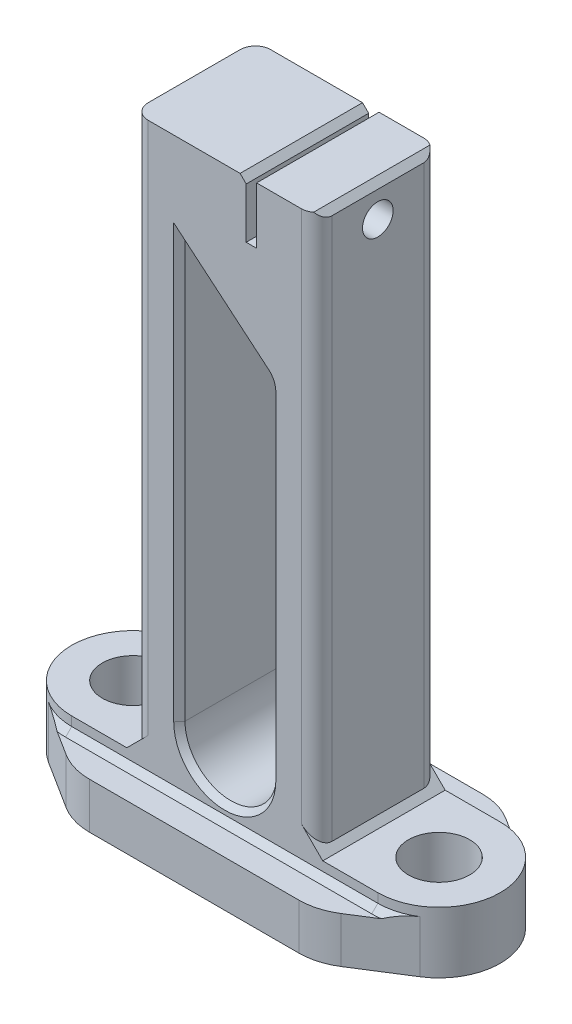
ISO-10303-21;
HEADER;
FILE_DESCRIPTION(('STEP AP214'),'2;1');
FILE_NAME('part.step','',(''),(''),'','','');
FILE_SCHEMA(('AUTOMOTIVE_DESIGN { 1 0 10303 214 1 1 1 1 }'));
ENDSEC;
DATA;
#1=APPLICATION_CONTEXT('core data for automotive mechanical design processes');
#2=APPLICATION_PROTOCOL_DEFINITION('international standard','automotive_design',2000,#1);
#3=PRODUCT_CONTEXT('',#1,'mechanical');
#4=PRODUCT('Part','Part','',(#3));
#5=PRODUCT_RELATED_PRODUCT_CATEGORY('part','',(#4));
#6=PRODUCT_DEFINITION_FORMATION('','',#4);
#7=PRODUCT_DEFINITION_CONTEXT('part definition',#1,'design');
#8=PRODUCT_DEFINITION('design','',#6,#7);
#9=PRODUCT_DEFINITION_SHAPE('','',#8);
#10=(LENGTH_UNIT() NAMED_UNIT(*) SI_UNIT(.MILLI.,.METRE.));
#11=(NAMED_UNIT(*) PLANE_ANGLE_UNIT() SI_UNIT($,.RADIAN.));
#12=(NAMED_UNIT(*) SI_UNIT($,.STERADIAN.) SOLID_ANGLE_UNIT());
#13=UNCERTAINTY_MEASURE_WITH_UNIT(LENGTH_MEASURE(1.E-05),#10,'distance_accuracy_value','');
#14=(GEOMETRIC_REPRESENTATION_CONTEXT(3) GLOBAL_UNCERTAINTY_ASSIGNED_CONTEXT((#13)) GLOBAL_UNIT_ASSIGNED_CONTEXT((#10,
#11,#12)) REPRESENTATION_CONTEXT('',''));
#15=CARTESIAN_POINT('',(0.,0.,0.));
#16=DIRECTION('',(0.,0.,1.));
#17=DIRECTION('',(1.,0.,0.));
#18=AXIS2_PLACEMENT_3D('',#15,#16,#17);
#19=CARTESIAN_POINT('',(0.,0.,10.));
#20=DIRECTION('',(0.,0.,-1.));
#21=DIRECTION('',(-1.,0.,0.));
#22=AXIS2_PLACEMENT_3D('',#19,#20,#21);
#23=PLANE('',#22);
#24=DIRECTION('',(0.,1.,0.));
#25=VECTOR('',#24,1.);
#26=CARTESIAN_POINT('',(-11.8390996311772,0.,10.));
#27=LINE('',#26,#25);
#28=CARTESIAN_POINT('',(-11.8390996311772,-73.75,10.));
#29=VERTEX_POINT('',#28);
#30=CARTESIAN_POINT('',(-11.8390996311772,-3.15729780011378,10.));
#31=VERTEX_POINT('',#30);
#32=EDGE_CURVE('E512',#29,#31,#27,.T.);
#33=ORIENTED_EDGE('',*,*,#32,.T.);
#34=DIRECTION('',(0.76604444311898,-0.642787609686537,0.));
#35=VECTOR('',#34,1.);
#36=CARTESIAN_POINT('',(-6.44629645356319,-7.68239695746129,10.));
#37=LINE('',#36,#35);
#38=CARTESIAN_POINT('',(3.64633187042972,-16.1511176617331,10.));
#39=VERTEX_POINT('',#38);
#40=EDGE_CURVE('E514',#31,#39,#37,.T.);
#41=ORIENTED_EDGE('',*,*,#40,.T.);
#42=CARTESIAN_POINT('',(1.5000000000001,-18.709016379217,10.));
#43=DIRECTION('',(0.,0.,-1.));
#44=DIRECTION('',(-1.,0.,0.));
#45=AXIS2_PLACEMENT_3D('',#42,#43,#44);
#46=CIRCLE('',#45,3.33909963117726);
#47=CARTESIAN_POINT('',(4.83909963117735,-18.709016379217,10.));
#48=VERTEX_POINT('',#47);
#49=EDGE_CURVE('E510',#39,#48,#46,.T.);
#50=ORIENTED_EDGE('',*,*,#49,.T.);
#51=DIRECTION('',(0.,-1.,0.));
#52=VECTOR('',#51,1.);
#53=CARTESIAN_POINT('',(4.83909963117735,0.,10.));
#54=LINE('',#53,#52);
#55=CARTESIAN_POINT('',(4.83909963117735,-73.75,10.));
#56=VERTEX_POINT('',#55);
#57=EDGE_CURVE('E506',#48,#56,#54,.T.);
#58=ORIENTED_EDGE('',*,*,#57,.T.);
#59=CARTESIAN_POINT('',(-3.4999999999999,-73.75,10.));
#60=DIRECTION('',(0.,0.,-1.));
#61=DIRECTION('',(-1.,0.,0.));
#62=AXIS2_PLACEMENT_3D('',#59,#60,#61);
#63=CIRCLE('',#62,8.33909963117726);
#64=EDGE_CURVE('E508',#56,#29,#63,.T.);
#65=ORIENTED_EDGE('',*,*,#64,.T.);
#66=EDGE_LOOP('',(#33,#41,#50,#58,#65));
#67=FACE_BOUND('',#66,.T.);
#68=DIRECTION('',(0.,-1.,0.));
#69=VECTOR('',#68,1.);
#70=CARTESIAN_POINT('',(-28.4999999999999,-81.25,10.));
#71=LINE('',#70,#69);
#72=CARTESIAN_POINT('',(-28.4999999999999,-81.25,10.));
#73=VERTEX_POINT('',#72);
#74=CARTESIAN_POINT('',(-28.4999999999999,-82.75,10.));
#75=VERTEX_POINT('',#74);
#76=EDGE_CURVE('E1008',#73,#75,#71,.T.);
#77=ORIENTED_EDGE('',*,*,#76,.T.);
#78=DIRECTION('',(1.,0.,0.));
#79=VECTOR('',#78,1.);
#80=CARTESIAN_POINT('',(21.5000000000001,-82.75,10.));
#81=LINE('',#80,#79);
#82=CARTESIAN_POINT('',(21.5000000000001,-82.75,10.));
#83=VERTEX_POINT('',#82);
#84=EDGE_CURVE('E627',#75,#83,#81,.T.);
#85=ORIENTED_EDGE('',*,*,#84,.T.);
#86=DIRECTION('',(0.,-1.,0.));
#87=VECTOR('',#86,1.);
#88=CARTESIAN_POINT('',(21.5000000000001,-81.25,10.));
#89=LINE('',#88,#87);
#90=CARTESIAN_POINT('',(21.5000000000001,-81.25,10.));
#91=VERTEX_POINT('',#90);
#92=EDGE_CURVE('E381',#91,#83,#89,.T.);
#93=ORIENTED_EDGE('',*,*,#92,.F.);
#94=DIRECTION('',(-1.,0.,0.));
#95=VECTOR('',#94,1.);
#96=CARTESIAN_POINT('',(11.5000000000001,-81.25,10.));
#97=LINE('',#96,#95);
#98=CARTESIAN_POINT('',(12.5000000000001,-81.25,10.));
#99=VERTEX_POINT('',#98);
#100=EDGE_CURVE('E379',#91,#99,#97,.T.);
#101=ORIENTED_EDGE('',*,*,#100,.T.);
#102=DIRECTION('',(0.707106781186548,-0.707106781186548,0.));
#103=VECTOR('',#102,1.);
#104=CARTESIAN_POINT('',(-34.3749999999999,-34.3749999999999,10.));
#105=LINE('',#104,#103);
#106=CARTESIAN_POINT('',(9.00000000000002,-77.7499999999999,10.));
#107=VERTEX_POINT('',#106);
#108=EDGE_CURVE('E455',#99,#107,#105,.F.);
#109=ORIENTED_EDGE('',*,*,#108,.T.);
#110=DIRECTION('',(0.,1.,0.));
#111=VECTOR('',#110,1.);
#112=CARTESIAN_POINT('',(9.00000000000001,0.,10.));
#113=LINE('',#112,#111);
#114=CARTESIAN_POINT('',(9.00000000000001,9.25,10.));
#115=VERTEX_POINT('',#114);
#116=EDGE_CURVE('E463',#107,#115,#113,.T.);
#117=ORIENTED_EDGE('',*,*,#116,.T.);
#118=DIRECTION('',(-1.,0.,0.));
#119=VECTOR('',#118,1.);
#120=CARTESIAN_POINT('',(11.5,9.24999999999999,10.));
#121=LINE('',#120,#119);
#122=CARTESIAN_POINT('',(1.7,9.25,10.));
#123=VERTEX_POINT('',#122);
#124=EDGE_CURVE('E397',#115,#123,#121,.T.);
#125=ORIENTED_EDGE('',*,*,#124,.T.);
#126=DIRECTION('',(0.,-1.,0.));
#127=VECTOR('',#126,1.);
#128=CARTESIAN_POINT('',(1.7,9.25,10.));
#129=LINE('',#128,#127);
#130=CARTESIAN_POINT('',(1.7,0.,10.));
#131=VERTEX_POINT('',#130);
#132=EDGE_CURVE('E399',#123,#131,#129,.T.);
#133=ORIENTED_EDGE('',*,*,#132,.T.);
#134=DIRECTION('',(-1.,0.,0.));
#135=VECTOR('',#134,1.);
#136=CARTESIAN_POINT('',(1.7,0.,10.));
#137=LINE('',#136,#135);
#138=CARTESIAN_POINT('',(0.,0.,10.));
#139=VERTEX_POINT('',#138);
#140=EDGE_CURVE('E387',#131,#139,#137,.T.);
#141=ORIENTED_EDGE('',*,*,#140,.T.);
#142=DIRECTION('',(0.,1.,0.));
#143=VECTOR('',#142,1.);
#144=CARTESIAN_POINT('',(0.,0.,10.));
#145=LINE('',#144,#143);
#146=CARTESIAN_POINT('',(0.,8.25000000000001,10.));
#147=VERTEX_POINT('',#146);
#148=EDGE_CURVE('E390',#139,#147,#145,.T.);
#149=ORIENTED_EDGE('',*,*,#148,.T.);
#150=DIRECTION('',(0.707106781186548,-0.707106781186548,0.));
#151=VECTOR('',#150,1.);
#152=CARTESIAN_POINT('',(-0.999999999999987,9.25,10.));
#153=LINE('',#152,#151);
#154=CARTESIAN_POINT('',(-0.999999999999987,9.25,10.));
#155=VERTEX_POINT('',#154);
#156=EDGE_CURVE('E444',#147,#155,#153,.F.);
#157=ORIENTED_EDGE('',*,*,#156,.T.);
#158=DIRECTION('',(-1.,0.,0.));
#159=VECTOR('',#158,1.);
#160=CARTESIAN_POINT('',(0.,9.25,10.));
#161=LINE('',#160,#159);
#162=CARTESIAN_POINT('',(-16.,9.25,10.));
#163=VERTEX_POINT('',#162);
#164=EDGE_CURVE('E394',#155,#163,#161,.T.);
#165=ORIENTED_EDGE('',*,*,#164,.T.);
#166=DIRECTION('',(0.,-1.,0.));
#167=VECTOR('',#166,1.);
#168=CARTESIAN_POINT('',(-16.,0.,10.));
#169=LINE('',#168,#167);
#170=CARTESIAN_POINT('',(-16.,-77.7500000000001,10.));
#171=VERTEX_POINT('',#170);
#172=EDGE_CURVE('E466',#163,#171,#169,.T.);
#173=ORIENTED_EDGE('',*,*,#172,.T.);
#174=DIRECTION('',(0.707106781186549,0.707106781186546,0.));
#175=VECTOR('',#174,1.);
#176=CARTESIAN_POINT('',(30.8750000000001,-30.8750000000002,10.));
#177=LINE('',#176,#175);
#178=CARTESIAN_POINT('',(-19.4999999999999,-81.25,10.));
#179=VERTEX_POINT('',#178);
#180=EDGE_CURVE('E449',#171,#179,#177,.F.);
#181=ORIENTED_EDGE('',*,*,#180,.T.);
#182=DIRECTION('',(-1.,0.,0.));
#183=VECTOR('',#182,1.);
#184=CARTESIAN_POINT('',(-18.4999999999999,-81.25,10.));
#185=LINE('',#184,#183);
#186=EDGE_CURVE('E1001',#179,#73,#185,.T.);
#187=ORIENTED_EDGE('',*,*,#186,.T.);
#188=EDGE_LOOP('',(#77,#85,#93,#101,#109,#117,#125,#133,#141,#149,#157,#165,#173,#181,#187));
#189=FACE_BOUND('',#188,.T.);
#190=ADVANCED_FACE('F40',(#67,#189),#23,.F.);
#191=CARTESIAN_POINT('',(-28.4999999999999,-81.25,0.));
#192=DIRECTION('',(0.,-1.,0.));
#193=DIRECTION('',(1.,0.,0.));
#194=AXIS2_PLACEMENT_3D('',#191,#192,#193);
#195=CYLINDRICAL_SURFACE('',#194,10.);
#196=DIRECTION('',(0.,-1.,0.));
#197=VECTOR('',#196,1.);
#198=CARTESIAN_POINT('',(-33.8484692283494,-83.75,8.44948974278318));
#199=LINE('',#198,#197);
#200=CARTESIAN_POINT('',(-33.8484692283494,-82.75,8.44948974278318));
#201=VERTEX_POINT('',#200);
#202=CARTESIAN_POINT('',(-33.8484692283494,-91.25,8.44948974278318));
#203=VERTEX_POINT('',#202);
#204=EDGE_CURVE('E361',#201,#203,#199,.T.);
#205=ORIENTED_EDGE('',*,*,#204,.F.);
#206=CARTESIAN_POINT('',(-28.4999999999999,-82.75,0.));
#207=DIRECTION('',(0.,-1.,0.));
#208=DIRECTION('',(0.,0.,-1.));
#209=AXIS2_PLACEMENT_3D('',#206,#207,#208);
#210=CIRCLE('',#209,10.);
#211=EDGE_CURVE('E625',#201,#75,#210,.F.);
#212=ORIENTED_EDGE('',*,*,#211,.T.);
#213=ORIENTED_EDGE('',*,*,#76,.F.);
#214=CARTESIAN_POINT('',(-28.4999999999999,-81.25,0.));
#215=DIRECTION('',(0.,-1.,0.));
#216=DIRECTION('',(1.,0.,0.));
#217=AXIS2_PLACEMENT_3D('',#214,#215,#216);
#218=CIRCLE('',#217,10.);
#219=CARTESIAN_POINT('',(-28.4999999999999,-81.25,-10.));
#220=VERTEX_POINT('',#219);
#221=EDGE_CURVE('E1003',#73,#220,#218,.T.);
#222=ORIENTED_EDGE('',*,*,#221,.T.);
#223=DIRECTION('',(0.,-1.,0.));
#224=VECTOR('',#223,1.);
#225=CARTESIAN_POINT('',(-28.4999999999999,-81.25,-10.));
#226=LINE('',#225,#224);
#227=CARTESIAN_POINT('',(-28.4999999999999,-82.75,-10.));
#228=VERTEX_POINT('',#227);
#229=EDGE_CURVE('E1011',#220,#228,#226,.T.);
#230=ORIENTED_EDGE('',*,*,#229,.T.);
#231=CARTESIAN_POINT('',(-28.4999999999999,-82.75,0.));
#232=DIRECTION('',(0.,-1.,0.));
#233=DIRECTION('',(0.,0.,-1.));
#234=AXIS2_PLACEMENT_3D('',#231,#232,#233);
#235=CIRCLE('',#234,10.);
#236=CARTESIAN_POINT('',(-33.8484692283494,-82.75,-8.44948974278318));
#237=VERTEX_POINT('',#236);
#238=EDGE_CURVE('E622',#228,#237,#235,.F.);
#239=ORIENTED_EDGE('',*,*,#238,.T.);
#240=DIRECTION('',(0.,-1.,0.));
#241=VECTOR('',#240,1.);
#242=CARTESIAN_POINT('',(-33.8484692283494,-83.75,-8.44948974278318));
#243=LINE('',#242,#241);
#244=CARTESIAN_POINT('',(-33.8484692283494,-91.25,-8.44948974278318));
#245=VERTEX_POINT('',#244);
#246=EDGE_CURVE('E569',#237,#245,#243,.T.);
#247=ORIENTED_EDGE('',*,*,#246,.T.);
#248=CARTESIAN_POINT('',(-28.4999999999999,-91.25,0.));
#249=DIRECTION('',(0.,-1.,0.));
#250=DIRECTION('',(-1.,0.,0.));
#251=AXIS2_PLACEMENT_3D('',#248,#249,#250);
#252=CIRCLE('',#251,10.);
#253=EDGE_CURVE('E998',#203,#245,#252,.T.);
#254=ORIENTED_EDGE('',*,*,#253,.F.);
#255=EDGE_LOOP('',(#205,#212,#213,#222,#230,#239,#247,#254));
#256=FACE_BOUND('',#255,.T.);
#257=ADVANCED_FACE('F753',(#256),#195,.T.);
#258=CARTESIAN_POINT('',(0.,0.,-10.));
#259=DIRECTION('',(0.,0.,-1.));
#260=DIRECTION('',(-1.,0.,0.));
#261=AXIS2_PLACEMENT_3D('',#258,#259,#260);
#262=PLANE('',#261);
#263=CARTESIAN_POINT('',(1.5000000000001,-18.709016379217,-10.));
#264=DIRECTION('',(0.,0.,-1.));
#265=DIRECTION('',(-1.,0.,0.));
#266=AXIS2_PLACEMENT_3D('',#263,#264,#265);
#267=CIRCLE('',#266,3.5);
#268=CARTESIAN_POINT('',(5.0000000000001,-18.709016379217,-10.));
#269=VERTEX_POINT('',#268);
#270=CARTESIAN_POINT('',(3.74975663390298,-16.0278608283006,-10.));
#271=VERTEX_POINT('',#270);
#272=EDGE_CURVE('E543',#269,#271,#267,.F.);
#273=ORIENTED_EDGE('',*,*,#272,.T.);
#274=DIRECTION('',(-0.76604444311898,0.642787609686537,0.));
#275=VECTOR('',#274,1.);
#276=CARTESIAN_POINT('',(-10.3572123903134,-4.19070832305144,-10.));
#277=LINE('',#276,#275);
#278=CARTESIAN_POINT('',(-11.9999999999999,-2.81224584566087,-10.));
#279=VERTEX_POINT('',#278);
#280=EDGE_CURVE('E547',#271,#279,#277,.T.);
#281=ORIENTED_EDGE('',*,*,#280,.T.);
#282=DIRECTION('',(0.,-1.,0.));
#283=VECTOR('',#282,1.);
#284=CARTESIAN_POINT('',(-11.9999999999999,-73.75,-10.));
#285=LINE('',#284,#283);
#286=CARTESIAN_POINT('',(-11.9999999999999,-73.75,-10.));
#287=VERTEX_POINT('',#286);
#288=EDGE_CURVE('E545',#279,#287,#285,.T.);
#289=ORIENTED_EDGE('',*,*,#288,.T.);
#290=CARTESIAN_POINT('',(-3.4999999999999,-73.75,-10.));
#291=DIRECTION('',(0.,0.,-1.));
#292=DIRECTION('',(-1.,0.,0.));
#293=AXIS2_PLACEMENT_3D('',#290,#291,#292);
#294=CIRCLE('',#293,8.5);
#295=CARTESIAN_POINT('',(5.0000000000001,-73.75,-10.));
#296=VERTEX_POINT('',#295);
#297=EDGE_CURVE('E541',#287,#296,#294,.F.);
#298=ORIENTED_EDGE('',*,*,#297,.T.);
#299=DIRECTION('',(0.,1.,0.));
#300=VECTOR('',#299,1.);
#301=CARTESIAN_POINT('',(5.0000000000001,-18.709016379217,-10.));
#302=LINE('',#301,#300);
#303=EDGE_CURVE('E539',#296,#269,#302,.T.);
#304=ORIENTED_EDGE('',*,*,#303,.T.);
#305=EDGE_LOOP('',(#273,#281,#289,#298,#304));
#306=FACE_BOUND('',#305,.T.);
#307=DIRECTION('',(0.,-1.,0.));
#308=VECTOR('',#307,1.);
#309=CARTESIAN_POINT('',(21.5000000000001,-81.25,-10.));
#310=LINE('',#309,#308);
#311=CARTESIAN_POINT('',(21.5000000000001,-81.25,-10.));
#312=VERTEX_POINT('',#311);
#313=CARTESIAN_POINT('',(21.5000000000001,-82.75,-10.));
#314=VERTEX_POINT('',#313);
#315=EDGE_CURVE('E384',#312,#314,#310,.T.);
#316=ORIENTED_EDGE('',*,*,#315,.T.);
#317=DIRECTION('',(-1.,0.,0.));
#318=VECTOR('',#317,1.);
#319=CARTESIAN_POINT('',(0.,-82.75,-10.));
#320=LINE('',#319,#318);
#321=EDGE_CURVE('E634',#314,#228,#320,.T.);
#322=ORIENTED_EDGE('',*,*,#321,.T.);
#323=ORIENTED_EDGE('',*,*,#229,.F.);
#324=DIRECTION('',(1.,0.,0.));
#325=VECTOR('',#324,1.);
#326=CARTESIAN_POINT('',(-18.4999999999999,-81.25,-10.));
#327=LINE('',#326,#325);
#328=CARTESIAN_POINT('',(-19.4999999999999,-81.25,-10.));
#329=VERTEX_POINT('',#328);
#330=EDGE_CURVE('E1005',#220,#329,#327,.T.);
#331=ORIENTED_EDGE('',*,*,#330,.T.);
#332=DIRECTION('',(-0.707106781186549,-0.707106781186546,0.));
#333=VECTOR('',#332,1.);
#334=CARTESIAN_POINT('',(-18.5,-80.25,-10.));
#335=LINE('',#334,#333);
#336=CARTESIAN_POINT('',(-16.,-77.7500000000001,-10.));
#337=VERTEX_POINT('',#336);
#338=EDGE_CURVE('E451',#329,#337,#335,.F.);
#339=ORIENTED_EDGE('',*,*,#338,.T.);
#340=DIRECTION('',(0.,-1.,0.));
#341=VECTOR('',#340,1.);
#342=CARTESIAN_POINT('',(-16.,9.25,-10.));
#343=LINE('',#342,#341);
#344=CARTESIAN_POINT('',(-16.,9.25,-10.));
#345=VERTEX_POINT('',#344);
#346=EDGE_CURVE('E481',#337,#345,#343,.F.);
#347=ORIENTED_EDGE('',*,*,#346,.T.);
#348=DIRECTION('',(-1.,0.,0.));
#349=VECTOR('',#348,1.);
#350=CARTESIAN_POINT('',(0.,9.25,-10.));
#351=LINE('',#350,#349);
#352=CARTESIAN_POINT('',(-0.999999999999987,9.25,-10.));
#353=VERTEX_POINT('',#352);
#354=EDGE_CURVE('E407',#353,#345,#351,.T.);
#355=ORIENTED_EDGE('',*,*,#354,.F.);
#356=DIRECTION('',(-0.707106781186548,0.707106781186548,0.));
#357=VECTOR('',#356,1.);
#358=CARTESIAN_POINT('',(4.12500000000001,4.12500000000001,-10.));
#359=LINE('',#358,#357);
#360=CARTESIAN_POINT('',(0.,8.25000000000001,-10.));
#361=VERTEX_POINT('',#360);
#362=EDGE_CURVE('E440',#353,#361,#359,.F.);
#363=ORIENTED_EDGE('',*,*,#362,.T.);
#364=DIRECTION('',(0.,1.,0.));
#365=VECTOR('',#364,1.);
#366=CARTESIAN_POINT('',(0.,0.,-10.));
#367=LINE('',#366,#365);
#368=CARTESIAN_POINT('',(0.,0.,-10.));
#369=VERTEX_POINT('',#368);
#370=EDGE_CURVE('E404',#369,#361,#367,.T.);
#371=ORIENTED_EDGE('',*,*,#370,.F.);
#372=DIRECTION('',(-1.,0.,0.));
#373=VECTOR('',#372,1.);
#374=CARTESIAN_POINT('',(1.7,0.,-10.));
#375=LINE('',#374,#373);
#376=CARTESIAN_POINT('',(1.7,0.,-10.));
#377=VERTEX_POINT('',#376);
#378=EDGE_CURVE('E383',#377,#369,#375,.T.);
#379=ORIENTED_EDGE('',*,*,#378,.F.);
#380=DIRECTION('',(0.,-1.,0.));
#381=VECTOR('',#380,1.);
#382=CARTESIAN_POINT('',(1.7,9.25,-10.));
#383=LINE('',#382,#381);
#384=CARTESIAN_POINT('',(1.7,9.25,-10.));
#385=VERTEX_POINT('',#384);
#386=EDGE_CURVE('E391',#385,#377,#383,.T.);
#387=ORIENTED_EDGE('',*,*,#386,.F.);
#388=DIRECTION('',(-1.,0.,0.));
#389=VECTOR('',#388,1.);
#390=CARTESIAN_POINT('',(11.5,9.24999999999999,-10.));
#391=LINE('',#390,#389);
#392=CARTESIAN_POINT('',(9.00000000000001,9.25,-10.));
#393=VERTEX_POINT('',#392);
#394=EDGE_CURVE('E410',#393,#385,#391,.T.);
#395=ORIENTED_EDGE('',*,*,#394,.F.);
#396=DIRECTION('',(0.,1.,0.));
#397=VECTOR('',#396,1.);
#398=CARTESIAN_POINT('',(9.00000000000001,-80.2499999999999,-10.));
#399=LINE('',#398,#397);
#400=CARTESIAN_POINT('',(9.00000000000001,-77.7499999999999,-10.));
#401=VERTEX_POINT('',#400);
#402=EDGE_CURVE('E478',#393,#401,#399,.F.);
#403=ORIENTED_EDGE('',*,*,#402,.T.);
#404=DIRECTION('',(-0.707106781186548,0.707106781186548,0.));
#405=VECTOR('',#404,1.);
#406=CARTESIAN_POINT('',(11.5,-80.2499999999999,-10.));
#407=LINE('',#406,#405);
#408=CARTESIAN_POINT('',(12.5000000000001,-81.25,-10.));
#409=VERTEX_POINT('',#408);
#410=EDGE_CURVE('E453',#401,#409,#407,.F.);
#411=ORIENTED_EDGE('',*,*,#410,.T.);
#412=DIRECTION('',(1.,0.,0.));
#413=VECTOR('',#412,1.);
#414=CARTESIAN_POINT('',(11.5000000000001,-81.25,-10.));
#415=LINE('',#414,#413);
#416=EDGE_CURVE('E369',#409,#312,#415,.T.);
#417=ORIENTED_EDGE('',*,*,#416,.T.);
#418=EDGE_LOOP('',(#316,#322,#323,#331,#339,#347,#355,#363,#371,#379,#387,#395,#403,#411,#417));
#419=FACE_BOUND('',#418,.T.);
#420=ADVANCED_FACE('F756',(#306,#419),#262,.T.);
#421=CARTESIAN_POINT('',(21.5000000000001,-81.25,0.));
#422=DIRECTION('',(0.,-1.,0.));
#423=DIRECTION('',(1.,0.,0.));
#424=AXIS2_PLACEMENT_3D('',#421,#422,#423);
#425=CYLINDRICAL_SURFACE('',#424,10.);
#426=ORIENTED_EDGE('',*,*,#92,.T.);
#427=CARTESIAN_POINT('',(21.5000000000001,-82.75,0.));
#428=DIRECTION('',(0.,-1.,0.));
#429=DIRECTION('',(0.,0.,-1.));
#430=AXIS2_PLACEMENT_3D('',#427,#428,#429);
#431=CIRCLE('',#430,10.);
#432=CARTESIAN_POINT('',(26.8484692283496,-82.75,8.44948974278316));
#433=VERTEX_POINT('',#432);
#434=EDGE_CURVE('E358',#83,#433,#431,.F.);
#435=ORIENTED_EDGE('',*,*,#434,.T.);
#436=DIRECTION('',(0.,-1.,0.));
#437=VECTOR('',#436,1.);
#438=CARTESIAN_POINT('',(26.8484692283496,-83.75,8.44948974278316));
#439=LINE('',#438,#437);
#440=CARTESIAN_POINT('',(26.8484692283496,-91.25,8.44948974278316));
#441=VERTEX_POINT('',#440);
#442=EDGE_CURVE('E343',#433,#441,#439,.T.);
#443=ORIENTED_EDGE('',*,*,#442,.T.);
#444=CARTESIAN_POINT('',(21.5000000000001,-91.25,0.));
#445=DIRECTION('',(0.,-1.,0.));
#446=DIRECTION('',(-1.,0.,0.));
#447=AXIS2_PLACEMENT_3D('',#444,#445,#446);
#448=CIRCLE('',#447,10.);
#449=CARTESIAN_POINT('',(26.8484692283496,-91.25,-8.44948974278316));
#450=VERTEX_POINT('',#449);
#451=EDGE_CURVE('E356',#450,#441,#448,.T.);
#452=ORIENTED_EDGE('',*,*,#451,.F.);
#453=DIRECTION('',(0.,-1.,0.));
#454=VECTOR('',#453,1.);
#455=CARTESIAN_POINT('',(26.8484692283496,-83.75,-8.44948974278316));
#456=LINE('',#455,#454);
#457=CARTESIAN_POINT('',(26.8484692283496,-82.75,-8.44948974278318));
#458=VERTEX_POINT('',#457);
#459=EDGE_CURVE('E966',#458,#450,#456,.T.);
#460=ORIENTED_EDGE('',*,*,#459,.F.);
#461=CARTESIAN_POINT('',(21.5000000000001,-82.75,0.));
#462=DIRECTION('',(0.,-1.,0.));
#463=DIRECTION('',(0.,0.,-1.));
#464=AXIS2_PLACEMENT_3D('',#461,#462,#463);
#465=CIRCLE('',#464,10.);
#466=EDGE_CURVE('E619',#458,#314,#465,.F.);
#467=ORIENTED_EDGE('',*,*,#466,.T.);
#468=ORIENTED_EDGE('',*,*,#315,.F.);
#469=CARTESIAN_POINT('',(21.5000000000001,-81.25,0.));
#470=DIRECTION('',(0.,-1.,0.));
#471=DIRECTION('',(1.,0.,0.));
#472=AXIS2_PLACEMENT_3D('',#469,#470,#471);
#473=CIRCLE('',#472,10.);
#474=EDGE_CURVE('E372',#312,#91,#473,.T.);
#475=ORIENTED_EDGE('',*,*,#474,.T.);
#476=EDGE_LOOP('',(#426,#435,#443,#452,#460,#467,#468,#475));
#477=FACE_BOUND('',#476,.T.);
#478=ADVANCED_FACE('F355',(#477),#425,.T.);
#479=CARTESIAN_POINT('',(1.7,0.,10.));
#480=DIRECTION('',(0.,-1.,0.));
#481=DIRECTION('',(1.,0.,0.));
#482=AXIS2_PLACEMENT_3D('',#479,#480,#481);
#483=PLANE('',#482);
#484=ORIENTED_EDGE('',*,*,#378,.T.);
#485=DIRECTION('',(0.,0.,-1.));
#486=VECTOR('',#485,1.);
#487=CARTESIAN_POINT('',(0.,0.,10.));
#488=LINE('',#487,#486);
#489=EDGE_CURVE('E421',#139,#369,#488,.T.);
#490=ORIENTED_EDGE('',*,*,#489,.F.);
#491=ORIENTED_EDGE('',*,*,#140,.F.);
#492=DIRECTION('',(0.,0.,-1.));
#493=VECTOR('',#492,1.);
#494=CARTESIAN_POINT('',(1.7,0.,10.));
#495=LINE('',#494,#493);
#496=EDGE_CURVE('E401',#131,#377,#495,.T.);
#497=ORIENTED_EDGE('',*,*,#496,.T.);
#498=EDGE_LOOP('',(#484,#490,#491,#497));
#499=FACE_BOUND('',#498,.T.);
#500=ADVANCED_FACE('F768',(#499),#483,.F.);
#501=CARTESIAN_POINT('',(0.,0.,10.));
#502=DIRECTION('',(-1.,0.,0.));
#503=DIRECTION('',(0.,0.,1.));
#504=AXIS2_PLACEMENT_3D('',#501,#502,#503);
#505=PLANE('',#504);
#506=CARTESIAN_POINT('',(0.,3.99999999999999,0.));
#507=DIRECTION('',(-1.,0.,0.));
#508=DIRECTION('',(0.,0.,1.));
#509=AXIS2_PLACEMENT_3D('',#506,#507,#508);
#510=CIRCLE('',#509,1.5);
#511=CARTESIAN_POINT('',(0.,3.99999999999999,1.5));
#512=VERTEX_POINT('',#511);
#513=EDGE_CURVE('E991',#512,#512,#510,.T.);
#514=ORIENTED_EDGE('',*,*,#513,.T.);
#515=EDGE_LOOP('',(#514));
#516=FACE_BOUND('',#515,.T.);
#517=ORIENTED_EDGE('',*,*,#370,.T.);
#518=DIRECTION('',(0.,0.,1.));
#519=VECTOR('',#518,1.);
#520=CARTESIAN_POINT('',(0.,8.25000000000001,10.));
#521=LINE('',#520,#519);
#522=EDGE_CURVE('E442',#361,#147,#521,.T.);
#523=ORIENTED_EDGE('',*,*,#522,.T.);
#524=ORIENTED_EDGE('',*,*,#148,.F.);
#525=ORIENTED_EDGE('',*,*,#489,.T.);
#526=EDGE_LOOP('',(#517,#523,#524,#525));
#527=FACE_BOUND('',#526,.T.);
#528=ADVANCED_FACE('F795',(#516,#527),#505,.F.);
#529=CARTESIAN_POINT('',(0.,9.25,10.));
#530=DIRECTION('',(0.,-1.,0.));
#531=DIRECTION('',(1.,0.,0.));
#532=AXIS2_PLACEMENT_3D('',#529,#530,#531);
#533=PLANE('',#532);
#534=DIRECTION('',(0.,0.,-1.));
#535=VECTOR('',#534,1.);
#536=CARTESIAN_POINT('',(-18.5,9.25,10.));
#537=LINE('',#536,#535);
#538=CARTESIAN_POINT('',(-18.5,9.25,7.5));
#539=VERTEX_POINT('',#538);
#540=CARTESIAN_POINT('',(-18.5,9.25,-7.5));
#541=VERTEX_POINT('',#540);
#542=EDGE_CURVE('E418',#539,#541,#537,.T.);
#543=ORIENTED_EDGE('',*,*,#542,.F.);
#544=CARTESIAN_POINT('',(-16.,9.25,7.5));
#545=DIRECTION('',(0.,-1.,0.));
#546=DIRECTION('',(1.,0.,0.));
#547=AXIS2_PLACEMENT_3D('',#544,#545,#546);
#548=CIRCLE('',#547,2.5);
#549=EDGE_CURVE('E476',#539,#163,#548,.F.);
#550=ORIENTED_EDGE('',*,*,#549,.T.);
#551=ORIENTED_EDGE('',*,*,#164,.F.);
#552=DIRECTION('',(0.,0.,-1.));
#553=VECTOR('',#552,1.);
#554=CARTESIAN_POINT('',(-0.999999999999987,9.25,10.));
#555=LINE('',#554,#553);
#556=EDGE_CURVE('E437',#155,#353,#555,.T.);
#557=ORIENTED_EDGE('',*,*,#556,.T.);
#558=ORIENTED_EDGE('',*,*,#354,.T.);
#559=CARTESIAN_POINT('',(-16.,9.25,-7.5));
#560=DIRECTION('',(0.,-1.,0.));
#561=DIRECTION('',(1.,0.,0.));
#562=AXIS2_PLACEMENT_3D('',#559,#560,#561);
#563=CIRCLE('',#562,2.5);
#564=EDGE_CURVE('E474',#345,#541,#563,.F.);
#565=ORIENTED_EDGE('',*,*,#564,.T.);
#566=EDGE_LOOP('',(#543,#550,#551,#557,#558,#565));
#567=FACE_BOUND('',#566,.T.);
#568=ADVANCED_FACE('F791',(#567),#533,.F.);
#569=CARTESIAN_POINT('',(-18.5,9.25,10.));
#570=DIRECTION('',(1.,0.,0.));
#571=DIRECTION('',(0.,1.,0.));
#572=AXIS2_PLACEMENT_3D('',#569,#570,#571);
#573=PLANE('',#572);
#574=CARTESIAN_POINT('',(-18.5,3.99999999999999,0.));
#575=DIRECTION('',(1.,0.,0.));
#576=DIRECTION('',(0.,1.,0.));
#577=AXIS2_PLACEMENT_3D('',#574,#575,#576);
#578=CIRCLE('',#577,1.5);
#579=CARTESIAN_POINT('',(-18.5,5.49999999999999,0.));
#580=VERTEX_POINT('',#579);
#581=EDGE_CURVE('E983',#580,#580,#578,.T.);
#582=ORIENTED_EDGE('',*,*,#581,.T.);
#583=EDGE_LOOP('',(#582));
#584=FACE_BOUND('',#583,.T.);
#585=DIRECTION('',(0.,0.,1.));
#586=VECTOR('',#585,1.);
#587=CARTESIAN_POINT('',(-18.5,-80.25,10.));
#588=LINE('',#587,#586);
#589=CARTESIAN_POINT('',(-18.5,-80.25,-7.5));
#590=VERTEX_POINT('',#589);
#591=CARTESIAN_POINT('',(-18.5,-80.25,7.5));
#592=VERTEX_POINT('',#591);
#593=EDGE_CURVE('E424',#590,#592,#588,.T.);
#594=ORIENTED_EDGE('',*,*,#593,.T.);
#595=DIRECTION('',(0.,-1.,0.));
#596=VECTOR('',#595,1.);
#597=CARTESIAN_POINT('',(-18.5,9.25,7.5));
#598=LINE('',#597,#596);
#599=EDGE_CURVE('E472',#592,#539,#598,.F.);
#600=ORIENTED_EDGE('',*,*,#599,.T.);
#601=ORIENTED_EDGE('',*,*,#542,.T.);
#602=DIRECTION('',(0.,-1.,0.));
#603=VECTOR('',#602,1.);
#604=CARTESIAN_POINT('',(-18.5,-80.25,-7.5));
#605=LINE('',#604,#603);
#606=EDGE_CURVE('E469',#541,#590,#605,.T.);
#607=ORIENTED_EDGE('',*,*,#606,.T.);
#608=EDGE_LOOP('',(#594,#600,#601,#607));
#609=FACE_BOUND('',#608,.T.);
#610=ADVANCED_FACE('F788',(#584,#609),#573,.F.);
#611=CARTESIAN_POINT('',(-18.5,-91.25,10.));
#612=DIRECTION('',(0.,1.,0.));
#613=DIRECTION('',(-1.,0.,0.));
#614=AXIS2_PLACEMENT_3D('',#611,#612,#613);
#615=PLANE('',#614);
#616=DIRECTION('',(-1.,0.,0.));
#617=VECTOR('',#616,1.);
#618=CARTESIAN_POINT('',(0.,-91.25,-15.));
#619=LINE('',#618,#617);
#620=CARTESIAN_POINT('',(13.6010205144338,-91.25,-15.));
#621=VERTEX_POINT('',#620);
#622=CARTESIAN_POINT('',(-20.6010205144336,-91.25,-15.));
#623=VERTEX_POINT('',#622);
#624=EDGE_CURVE('E360',#621,#623,#619,.T.);
#625=ORIENTED_EDGE('',*,*,#624,.F.);
#626=CARTESIAN_POINT('',(13.6010205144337,-91.25,-4.99999999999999));
#627=DIRECTION('',(0.,1.,0.));
#628=DIRECTION('',(-1.,0.,0.));
#629=AXIS2_PLACEMENT_3D('',#626,#627,#628);
#630=CIRCLE('',#629,10.);
#631=CARTESIAN_POINT('',(18.9494897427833,-91.25,-13.4494897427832));
#632=VERTEX_POINT('',#631);
#633=EDGE_CURVE('E589',#621,#632,#630,.F.);
#634=ORIENTED_EDGE('',*,*,#633,.T.);
#635=DIRECTION('',(0.844948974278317,0.,0.534846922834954));
#636=VECTOR('',#635,1.);
#637=CARTESIAN_POINT('',(11.498785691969,-91.25,-18.1657344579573));
#638=LINE('',#637,#636);
#639=EDGE_CURVE('E367',#632,#450,#638,.T.);
#640=ORIENTED_EDGE('',*,*,#639,.T.);
#641=ORIENTED_EDGE('',*,*,#451,.T.);
#642=DIRECTION('',(0.844948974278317,0.,-0.534846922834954));
#643=VECTOR('',#642,1.);
#644=CARTESIAN_POINT('',(11.498785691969,-91.25,18.1657344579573));
#645=LINE('',#644,#643);
#646=CARTESIAN_POINT('',(18.9494897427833,-91.25,13.4494897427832));
#647=VERTEX_POINT('',#646);
#648=EDGE_CURVE('E339',#647,#441,#645,.T.);
#649=ORIENTED_EDGE('',*,*,#648,.F.);
#650=CARTESIAN_POINT('',(13.6010205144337,-91.25,4.99999999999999));
#651=DIRECTION('',(0.,1.,0.));
#652=DIRECTION('',(-1.,0.,0.));
#653=AXIS2_PLACEMENT_3D('',#650,#651,#652);
#654=CIRCLE('',#653,10.);
#655=CARTESIAN_POINT('',(13.6010205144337,-91.25,15.));
#656=VERTEX_POINT('',#655);
#657=EDGE_CURVE('E587',#647,#656,#654,.F.);
#658=ORIENTED_EDGE('',*,*,#657,.T.);
#659=DIRECTION('',(-1.,0.,0.));
#660=VECTOR('',#659,1.);
#661=CARTESIAN_POINT('',(0.,-91.25,15.));
#662=LINE('',#661,#660);
#663=CARTESIAN_POINT('',(-20.6010205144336,-91.25,15.));
#664=VERTEX_POINT('',#663);
#665=EDGE_CURVE('E349',#656,#664,#662,.T.);
#666=ORIENTED_EDGE('',*,*,#665,.T.);
#667=CARTESIAN_POINT('',(-20.6010205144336,-91.25,5.));
#668=DIRECTION('',(0.,1.,0.));
#669=DIRECTION('',(-1.,0.,0.));
#670=AXIS2_PLACEMENT_3D('',#667,#668,#669);
#671=CIRCLE('',#670,10.);
#672=CARTESIAN_POINT('',(-25.9494897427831,-91.25,13.4494897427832));
#673=VERTEX_POINT('',#672);
#674=EDGE_CURVE('E585',#664,#673,#671,.F.);
#675=ORIENTED_EDGE('',*,*,#674,.T.);
#676=DIRECTION('',(-0.844948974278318,0.,-0.534846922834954));
#677=VECTOR('',#676,1.);
#678=CARTESIAN_POINT('',(-13.501214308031,-91.25,21.3291629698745));
#679=LINE('',#678,#677);
#680=EDGE_CURVE('E949',#673,#203,#679,.T.);
#681=ORIENTED_EDGE('',*,*,#680,.T.);
#682=ORIENTED_EDGE('',*,*,#253,.T.);
#683=DIRECTION('',(-0.844948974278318,0.,0.534846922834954));
#684=VECTOR('',#683,1.);
#685=CARTESIAN_POINT('',(-13.501214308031,-91.25,-21.3291629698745));
#686=LINE('',#685,#684);
#687=CARTESIAN_POINT('',(-25.9494897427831,-91.25,-13.4494897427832));
#688=VERTEX_POINT('',#687);
#689=EDGE_CURVE('E960',#688,#245,#686,.T.);
#690=ORIENTED_EDGE('',*,*,#689,.F.);
#691=CARTESIAN_POINT('',(-20.6010205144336,-91.25,-5.));
#692=DIRECTION('',(0.,1.,0.));
#693=DIRECTION('',(-1.,0.,0.));
#694=AXIS2_PLACEMENT_3D('',#691,#692,#693);
#695=CIRCLE('',#694,10.);
#696=EDGE_CURVE('E583',#688,#623,#695,.F.);
#697=ORIENTED_EDGE('',*,*,#696,.T.);
#698=EDGE_LOOP('',(#625,#634,#640,#641,#649,#658,#666,#675,#681,#682,#690,#697));
#699=FACE_BOUND('',#698,.T.);
#700=CARTESIAN_POINT('',(21.5000000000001,-91.25,0.));
#701=DIRECTION('',(0.,-1.,0.));
#702=DIRECTION('',(1.,0.,0.));
#703=AXIS2_PLACEMENT_3D('',#700,#701,#702);
#704=CIRCLE('',#703,5.);
#705=CARTESIAN_POINT('',(26.5000000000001,-91.25,0.));
#706=VERTEX_POINT('',#705);
#707=EDGE_CURVE('E375',#706,#706,#704,.T.);
#708=ORIENTED_EDGE('',*,*,#707,.F.);
#709=EDGE_LOOP('',(#708));
#710=FACE_BOUND('',#709,.T.);
#711=CARTESIAN_POINT('',(-28.4999999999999,-91.25,0.));
#712=DIRECTION('',(0.,-1.,0.));
#713=DIRECTION('',(-1.,0.,0.));
#714=AXIS2_PLACEMENT_3D('',#711,#712,#713);
#715=CIRCLE('',#714,5.);
#716=CARTESIAN_POINT('',(-33.4999999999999,-91.25,0.));
#717=VERTEX_POINT('',#716);
#718=EDGE_CURVE('E994',#717,#717,#715,.T.);
#719=ORIENTED_EDGE('',*,*,#718,.F.);
#720=EDGE_LOOP('',(#719));
#721=FACE_BOUND('',#720,.T.);
#722=ADVANCED_FACE('F364',(#699,#710,#721),#615,.F.);
#723=CARTESIAN_POINT('',(11.5,-91.25,10.));
#724=DIRECTION('',(-1.,0.,0.));
#725=DIRECTION('',(0.,0.,1.));
#726=AXIS2_PLACEMENT_3D('',#723,#724,#725);
#727=PLANE('',#726);
#728=CARTESIAN_POINT('',(11.5,3.99999999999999,0.));
#729=DIRECTION('',(1.,0.,0.));
#730=DIRECTION('',(0.,0.,-1.));
#731=AXIS2_PLACEMENT_3D('',#728,#729,#730);
#732=CIRCLE('',#731,2.5);
#733=CARTESIAN_POINT('',(11.5,3.99999999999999,-2.5));
#734=VERTEX_POINT('',#733);
#735=EDGE_CURVE('E565',#734,#734,#732,.T.);
#736=ORIENTED_EDGE('',*,*,#735,.F.);
#737=EDGE_LOOP('',(#736));
#738=FACE_BOUND('',#737,.T.);
#739=DIRECTION('',(0.,0.,1.));
#740=VECTOR('',#739,1.);
#741=CARTESIAN_POINT('',(11.5,8.25000000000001,10.));
#742=LINE('',#741,#740);
#743=CARTESIAN_POINT('',(11.5,8.25000000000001,-7.5));
#744=VERTEX_POINT('',#743);
#745=CARTESIAN_POINT('',(11.5,8.25000000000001,7.5));
#746=VERTEX_POINT('',#745);
#747=EDGE_CURVE('E429',#744,#746,#742,.T.);
#748=ORIENTED_EDGE('',*,*,#747,.T.);
#749=DIRECTION('',(0.,1.,0.));
#750=VECTOR('',#749,1.);
#751=CARTESIAN_POINT('',(11.5,-91.25,7.5));
#752=LINE('',#751,#750);
#753=CARTESIAN_POINT('',(11.5,-80.2499999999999,7.5));
#754=VERTEX_POINT('',#753);
#755=EDGE_CURVE('E494',#746,#754,#752,.F.);
#756=ORIENTED_EDGE('',*,*,#755,.T.);
#757=DIRECTION('',(0.,0.,-1.));
#758=VECTOR('',#757,1.);
#759=CARTESIAN_POINT('',(11.5,-80.2499999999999,-10.));
#760=LINE('',#759,#758);
#761=CARTESIAN_POINT('',(11.5,-80.2499999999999,-7.5));
#762=VERTEX_POINT('',#761);
#763=EDGE_CURVE('E432',#754,#762,#760,.T.);
#764=ORIENTED_EDGE('',*,*,#763,.T.);
#765=DIRECTION('',(0.,1.,0.));
#766=VECTOR('',#765,1.);
#767=CARTESIAN_POINT('',(11.5,8.25000000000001,-7.5));
#768=LINE('',#767,#766);
#769=EDGE_CURVE('E491',#762,#744,#768,.T.);
#770=ORIENTED_EDGE('',*,*,#769,.T.);
#771=EDGE_LOOP('',(#748,#756,#764,#770));
#772=FACE_BOUND('',#771,.T.);
#773=ADVANCED_FACE('F781',(#738,#772),#727,.F.);
#774=CARTESIAN_POINT('',(11.5,9.24999999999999,10.));
#775=DIRECTION('',(0.,-1.,0.));
#776=DIRECTION('',(1.,0.,0.));
#777=AXIS2_PLACEMENT_3D('',#774,#775,#776);
#778=PLANE('',#777);
#779=ORIENTED_EDGE('',*,*,#124,.F.);
#780=CARTESIAN_POINT('',(9.00000000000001,9.25,7.5));
#781=DIRECTION('',(0.,-1.,0.));
#782=DIRECTION('',(1.,0.,0.));
#783=AXIS2_PLACEMENT_3D('',#780,#781,#782);
#784=CIRCLE('',#783,2.5);
#785=CARTESIAN_POINT('',(10.5,9.24999999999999,9.49999999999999));
#786=VERTEX_POINT('',#785);
#787=EDGE_CURVE('E485',#115,#786,#784,.F.);
#788=ORIENTED_EDGE('',*,*,#787,.T.);
#789=DIRECTION('',(0.,0.,-1.));
#790=VECTOR('',#789,1.);
#791=CARTESIAN_POINT('',(10.5,9.24999999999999,10.));
#792=LINE('',#791,#790);
#793=CARTESIAN_POINT('',(10.5,9.24999999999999,-9.49999999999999));
#794=VERTEX_POINT('',#793);
#795=EDGE_CURVE('E446',#786,#794,#792,.T.);
#796=ORIENTED_EDGE('',*,*,#795,.T.);
#797=CARTESIAN_POINT('',(9.00000000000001,9.24999999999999,-7.5));
#798=DIRECTION('',(0.,-1.,0.));
#799=DIRECTION('',(1.,0.,0.));
#800=AXIS2_PLACEMENT_3D('',#797,#798,#799);
#801=CIRCLE('',#800,2.5);
#802=EDGE_CURVE('E483',#794,#393,#801,.F.);
#803=ORIENTED_EDGE('',*,*,#802,.T.);
#804=ORIENTED_EDGE('',*,*,#394,.T.);
#805=DIRECTION('',(0.,0.,-1.));
#806=VECTOR('',#805,1.);
#807=CARTESIAN_POINT('',(1.7,9.25,10.));
#808=LINE('',#807,#806);
#809=EDGE_CURVE('E415',#123,#385,#808,.T.);
#810=ORIENTED_EDGE('',*,*,#809,.F.);
#811=EDGE_LOOP('',(#779,#788,#796,#803,#804,#810));
#812=FACE_BOUND('',#811,.T.);
#813=ADVANCED_FACE('F777',(#812),#778,.F.);
#814=CARTESIAN_POINT('',(1.7,9.25,10.));
#815=DIRECTION('',(1.,0.,0.));
#816=DIRECTION('',(0.,1.,0.));
#817=AXIS2_PLACEMENT_3D('',#814,#815,#816);
#818=PLANE('',#817);
#819=CARTESIAN_POINT('',(1.7,3.99999999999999,0.));
#820=DIRECTION('',(1.,0.,0.));
#821=DIRECTION('',(0.,1.,0.));
#822=AXIS2_PLACEMENT_3D('',#819,#820,#821);
#823=CIRCLE('',#822,2.5);
#824=CARTESIAN_POINT('',(1.7,3.99999999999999,-2.5));
#825=VERTEX_POINT('',#824);
#826=EDGE_CURVE('E976',#825,#825,#823,.F.);
#827=ORIENTED_EDGE('',*,*,#826,.F.);
#828=EDGE_LOOP('',(#827));
#829=FACE_BOUND('',#828,.T.);
#830=ORIENTED_EDGE('',*,*,#386,.T.);
#831=ORIENTED_EDGE('',*,*,#496,.F.);
#832=ORIENTED_EDGE('',*,*,#132,.F.);
#833=ORIENTED_EDGE('',*,*,#809,.T.);
#834=EDGE_LOOP('',(#830,#831,#832,#833));
#835=FACE_BOUND('',#834,.T.);
#836=ADVANCED_FACE('F764',(#829,#835),#818,.F.);
#837=CARTESIAN_POINT('',(21.5000000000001,-81.25,0.));
#838=DIRECTION('',(0.,-1.,0.));
#839=DIRECTION('',(1.,0.,0.));
#840=AXIS2_PLACEMENT_3D('',#837,#838,#839);
#841=PLANE('',#840);
#842=CARTESIAN_POINT('',(21.5000000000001,-81.25,0.));
#843=DIRECTION('',(0.,-1.,0.));
#844=DIRECTION('',(1.,0.,0.));
#845=AXIS2_PLACEMENT_3D('',#842,#843,#844);
#846=CIRCLE('',#845,5.);
#847=CARTESIAN_POINT('',(26.5000000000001,-81.25,0.));
#848=VERTEX_POINT('',#847);
#849=EDGE_CURVE('E370',#848,#848,#846,.T.);
#850=ORIENTED_EDGE('',*,*,#849,.T.);
#851=EDGE_LOOP('',(#850));
#852=FACE_BOUND('',#851,.T.);
#853=ORIENTED_EDGE('',*,*,#416,.F.);
#854=DIRECTION('',(0.,0.,1.));
#855=VECTOR('',#854,1.);
#856=CARTESIAN_POINT('',(12.5000000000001,-81.25,10.));
#857=LINE('',#856,#855);
#858=EDGE_CURVE('E435',#409,#99,#857,.T.);
#859=ORIENTED_EDGE('',*,*,#858,.T.);
#860=ORIENTED_EDGE('',*,*,#100,.F.);
#861=ORIENTED_EDGE('',*,*,#474,.F.);
#862=EDGE_LOOP('',(#853,#859,#860,#861));
#863=FACE_BOUND('',#862,.T.);
#864=ADVANCED_FACE('F760',(#852,#863),#841,.F.);
#865=CARTESIAN_POINT('',(21.5000000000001,-81.25,0.));
#866=DIRECTION('',(0.,-1.,0.));
#867=DIRECTION('',(1.,0.,0.));
#868=AXIS2_PLACEMENT_3D('',#865,#866,#867);
#869=CYLINDRICAL_SURFACE('',#868,5.);
#870=ORIENTED_EDGE('',*,*,#849,.F.);
#871=EDGE_LOOP('',(#870));
#872=FACE_BOUND('',#871,.T.);
#873=ORIENTED_EDGE('',*,*,#707,.T.);
#874=EDGE_LOOP('',(#873));
#875=FACE_BOUND('',#874,.T.);
#876=ADVANCED_FACE('F751',(#872,#875),#869,.F.);
#877=CARTESIAN_POINT('',(-28.4999999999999,-81.25,0.));
#878=DIRECTION('',(0.,-1.,0.));
#879=DIRECTION('',(1.,0.,0.));
#880=AXIS2_PLACEMENT_3D('',#877,#878,#879);
#881=PLANE('',#880);
#882=CARTESIAN_POINT('',(-28.4999999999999,-81.25,0.));
#883=DIRECTION('',(0.,-1.,0.));
#884=DIRECTION('',(-1.,0.,0.));
#885=AXIS2_PLACEMENT_3D('',#882,#883,#884);
#886=CIRCLE('',#885,5.);
#887=CARTESIAN_POINT('',(-33.4999999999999,-81.25,0.));
#888=VERTEX_POINT('',#887);
#889=EDGE_CURVE('E995',#888,#888,#886,.T.);
#890=ORIENTED_EDGE('',*,*,#889,.T.);
#891=EDGE_LOOP('',(#890));
#892=FACE_BOUND('',#891,.T.);
#893=ORIENTED_EDGE('',*,*,#186,.F.);
#894=DIRECTION('',(0.,0.,-1.));
#895=VECTOR('',#894,1.);
#896=CARTESIAN_POINT('',(-19.4999999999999,-81.25,-10.));
#897=LINE('',#896,#895);
#898=EDGE_CURVE('E427',#179,#329,#897,.T.);
#899=ORIENTED_EDGE('',*,*,#898,.T.);
#900=ORIENTED_EDGE('',*,*,#330,.F.);
#901=ORIENTED_EDGE('',*,*,#221,.F.);
#902=EDGE_LOOP('',(#893,#899,#900,#901));
#903=FACE_BOUND('',#902,.T.);
#904=ADVANCED_FACE('F747',(#892,#903),#881,.F.);
#905=CARTESIAN_POINT('',(-28.4999999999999,-81.25,0.));
#906=DIRECTION('',(0.,-1.,0.));
#907=DIRECTION('',(1.,0.,0.));
#908=AXIS2_PLACEMENT_3D('',#905,#906,#907);
#909=CYLINDRICAL_SURFACE('',#908,5.);
#910=ORIENTED_EDGE('',*,*,#889,.F.);
#911=EDGE_LOOP('',(#910));
#912=FACE_BOUND('',#911,.T.);
#913=ORIENTED_EDGE('',*,*,#718,.T.);
#914=EDGE_LOOP('',(#913));
#915=FACE_BOUND('',#914,.T.);
#916=ADVANCED_FACE('F743',(#912,#915),#909,.F.);
#917=CARTESIAN_POINT('',(-38.4999999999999,3.99999999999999,0.));
#918=DIRECTION('',(1.,0.,0.));
#919=DIRECTION('',(0.,0.,-1.));
#920=AXIS2_PLACEMENT_3D('',#917,#918,#919);
#921=CYLINDRICAL_SURFACE('',#920,1.5);
#922=ORIENTED_EDGE('',*,*,#581,.F.);
#923=EDGE_LOOP('',(#922));
#924=FACE_BOUND('',#923,.T.);
#925=ORIENTED_EDGE('',*,*,#513,.F.);
#926=EDGE_LOOP('',(#925));
#927=FACE_BOUND('',#926,.T.);
#928=ADVANCED_FACE('F739',(#924,#927),#921,.F.);
#929=CARTESIAN_POINT('',(-18.5,-80.25,10.));
#930=DIRECTION('',(-0.707106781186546,0.707106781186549,0.));
#931=DIRECTION('',(0.,0.,-1.));
#932=AXIS2_PLACEMENT_3D('',#929,#930,#931);
#933=PLANE('',#932);
#934=ORIENTED_EDGE('',*,*,#338,.F.);
#935=ORIENTED_EDGE('',*,*,#898,.F.);
#936=ORIENTED_EDGE('',*,*,#180,.F.);
#937=CARTESIAN_POINT('',(-16.,-77.7500000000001,7.5));
#938=DIRECTION('',(-0.707106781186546,0.707106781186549,0.));
#939=DIRECTION('',(-0.707106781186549,-0.707106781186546,0.));
#940=AXIS2_PLACEMENT_3D('',#937,#938,#939);
#941=ELLIPSE('',#940,3.53553390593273,2.5);
#942=EDGE_CURVE('E496',#171,#592,#941,.F.);
#943=ORIENTED_EDGE('',*,*,#942,.T.);
#944=ORIENTED_EDGE('',*,*,#593,.F.);
#945=CARTESIAN_POINT('',(-16.,-77.7500000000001,-7.5));
#946=DIRECTION('',(-0.707106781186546,0.707106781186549,0.));
#947=DIRECTION('',(0.707106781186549,0.707106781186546,0.));
#948=AXIS2_PLACEMENT_3D('',#945,#946,#947);
#949=ELLIPSE('',#948,3.53553390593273,2.5);
#950=EDGE_CURVE('E498',#590,#337,#949,.F.);
#951=ORIENTED_EDGE('',*,*,#950,.T.);
#952=EDGE_LOOP('',(#934,#935,#936,#943,#944,#951));
#953=FACE_BOUND('',#952,.T.);
#954=ADVANCED_FACE('F742',(#953),#933,.T.);
#955=CARTESIAN_POINT('',(11.5,-80.2499999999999,10.));
#956=DIRECTION('',(0.707106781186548,0.707106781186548,0.));
#957=DIRECTION('',(0.,0.,1.));
#958=AXIS2_PLACEMENT_3D('',#955,#956,#957);
#959=PLANE('',#958);
#960=ORIENTED_EDGE('',*,*,#108,.F.);
#961=ORIENTED_EDGE('',*,*,#858,.F.);
#962=ORIENTED_EDGE('',*,*,#410,.F.);
#963=CARTESIAN_POINT('',(9.00000000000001,-77.7499999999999,-7.5));
#964=DIRECTION('',(0.707106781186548,0.707106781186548,0.));
#965=DIRECTION('',(0.707106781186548,-0.707106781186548,0.));
#966=AXIS2_PLACEMENT_3D('',#963,#964,#965);
#967=ELLIPSE('',#966,3.53553390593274,2.5);
#968=EDGE_CURVE('E504',#401,#762,#967,.F.);
#969=ORIENTED_EDGE('',*,*,#968,.T.);
#970=ORIENTED_EDGE('',*,*,#763,.F.);
#971=CARTESIAN_POINT('',(9.00000000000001,-77.7499999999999,7.5));
#972=DIRECTION('',(0.707106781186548,0.707106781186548,0.));
#973=DIRECTION('',(-0.707106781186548,0.707106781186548,0.));
#974=AXIS2_PLACEMENT_3D('',#971,#972,#973);
#975=ELLIPSE('',#974,3.53553390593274,2.5);
#976=EDGE_CURVE('E501',#754,#107,#975,.F.);
#977=ORIENTED_EDGE('',*,*,#976,.T.);
#978=EDGE_LOOP('',(#960,#961,#962,#969,#970,#977));
#979=FACE_BOUND('',#978,.T.);
#980=ADVANCED_FACE('F809',(#979),#959,.T.);
#981=CARTESIAN_POINT('',(-0.999999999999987,9.25,10.));
#982=DIRECTION('',(-0.707106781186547,-0.707106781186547,0.));
#983=DIRECTION('',(0.,0.,-1.));
#984=AXIS2_PLACEMENT_3D('',#981,#982,#983);
#985=PLANE('',#984);
#986=ORIENTED_EDGE('',*,*,#156,.F.);
#987=ORIENTED_EDGE('',*,*,#522,.F.);
#988=ORIENTED_EDGE('',*,*,#362,.F.);
#989=ORIENTED_EDGE('',*,*,#556,.F.);
#990=EDGE_LOOP('',(#986,#987,#988,#989));
#991=FACE_BOUND('',#990,.T.);
#992=ADVANCED_FACE('F816',(#991),#985,.F.);
#993=CARTESIAN_POINT('',(10.5,9.24999999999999,10.));
#994=DIRECTION('',(-0.707106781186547,-0.707106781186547,0.));
#995=DIRECTION('',(0.,0.,-1.));
#996=AXIS2_PLACEMENT_3D('',#993,#994,#995);
#997=PLANE('',#996);
#998=ORIENTED_EDGE('',*,*,#795,.F.);
#999=CARTESIAN_POINT('',(9.00000000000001,10.75,7.5));
#1000=DIRECTION('',(-0.707106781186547,-0.707106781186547,0.));
#1001=DIRECTION('',(-0.707106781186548,0.707106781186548,0.));
#1002=AXIS2_PLACEMENT_3D('',#999,#1000,#1001);
#1003=ELLIPSE('',#1002,3.53553390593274,2.5);
#1004=EDGE_CURVE('E489',#786,#746,#1003,.F.);
#1005=ORIENTED_EDGE('',*,*,#1004,.T.);
#1006=ORIENTED_EDGE('',*,*,#747,.F.);
#1007=CARTESIAN_POINT('',(9.00000000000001,10.75,-7.5));
#1008=DIRECTION('',(-0.707106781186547,-0.707106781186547,0.));
#1009=DIRECTION('',(0.707106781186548,-0.707106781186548,0.));
#1010=AXIS2_PLACEMENT_3D('',#1007,#1008,#1009);
#1011=ELLIPSE('',#1010,3.53553390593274,2.5);
#1012=EDGE_CURVE('E487',#744,#794,#1011,.F.);
#1013=ORIENTED_EDGE('',*,*,#1012,.T.);
#1014=EDGE_LOOP('',(#998,#1005,#1006,#1013));
#1015=FACE_BOUND('',#1014,.T.);
#1016=ADVANCED_FACE('F725',(#1015),#997,.F.);
#1017=CARTESIAN_POINT('',(-10.9999999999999,-17.5432472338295,10.));
#1018=DIRECTION('',(-1.,0.,0.));
#1019=DIRECTION('',(0.,0.,1.));
#1020=AXIS2_PLACEMENT_3D('',#1017,#1018,#1019);
#1021=PLANE('',#1020);
#1022=DIRECTION('',(0.,0.,-1.));
#1023=VECTOR('',#1022,1.);
#1024=CARTESIAN_POINT('',(-10.9999999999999,-4.95675276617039,10.));
#1025=LINE('',#1024,#1023);
#1026=CARTESIAN_POINT('',(-10.9999999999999,-4.95675276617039,9.00000000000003));
#1027=VERTEX_POINT('',#1026);
#1028=CARTESIAN_POINT('',(-10.9999999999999,-4.95675276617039,-9.16090036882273));
#1029=VERTEX_POINT('',#1028);
#1030=EDGE_CURVE('E980',#1027,#1029,#1025,.T.);
#1031=ORIENTED_EDGE('',*,*,#1030,.F.);
#1032=DIRECTION('',(0.,-1.,0.));
#1033=VECTOR('',#1032,1.);
#1034=CARTESIAN_POINT('',(-10.9999999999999,-17.5432472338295,9.00000000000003));
#1035=LINE('',#1034,#1033);
#1036=CARTESIAN_POINT('',(-10.9999999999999,-73.75,9.00000000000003));
#1037=VERTEX_POINT('',#1036);
#1038=EDGE_CURVE('E525',#1027,#1037,#1035,.T.);
#1039=ORIENTED_EDGE('',*,*,#1038,.T.);
#1040=DIRECTION('',(0.,0.,-1.));
#1041=VECTOR('',#1040,1.);
#1042=CARTESIAN_POINT('',(-10.9999999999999,-73.75,10.));
#1043=LINE('',#1042,#1041);
#1044=CARTESIAN_POINT('',(-10.9999999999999,-73.75,-9.16090036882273));
#1045=VERTEX_POINT('',#1044);
#1046=EDGE_CURVE('E984',#1037,#1045,#1043,.T.);
#1047=ORIENTED_EDGE('',*,*,#1046,.T.);
#1048=DIRECTION('',(0.,1.,0.));
#1049=VECTOR('',#1048,1.);
#1050=CARTESIAN_POINT('',(-10.9999999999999,-4.95675276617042,-9.16090036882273));
#1051=LINE('',#1050,#1049);
#1052=EDGE_CURVE('E523',#1045,#1029,#1051,.T.);
#1053=ORIENTED_EDGE('',*,*,#1052,.T.);
#1054=EDGE_LOOP('',(#1031,#1039,#1047,#1053));
#1055=FACE_BOUND('',#1054,.T.);
#1056=ADVANCED_FACE('F721',(#1055),#1021,.F.);
#1057=CARTESIAN_POINT('',(-3.4999999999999,-73.75,10.));
#1058=DIRECTION('',(0.,0.,-1.));
#1059=DIRECTION('',(-1.,0.,0.));
#1060=AXIS2_PLACEMENT_3D('',#1057,#1058,#1059);
#1061=CYLINDRICAL_SURFACE('',#1060,7.5);
#1062=ORIENTED_EDGE('',*,*,#1046,.F.);
#1063=CARTESIAN_POINT('',(-3.4999999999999,-73.75,9.00000000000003));
#1064=DIRECTION('',(0.,0.,-1.));
#1065=DIRECTION('',(-1.,0.,0.));
#1066=AXIS2_PLACEMENT_3D('',#1063,#1064,#1065);
#1067=CIRCLE('',#1066,7.5);
#1068=CARTESIAN_POINT('',(4.0000000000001,-73.75,9.00000000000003));
#1069=VERTEX_POINT('',#1068);
#1070=EDGE_CURVE('E533',#1037,#1069,#1067,.F.);
#1071=ORIENTED_EDGE('',*,*,#1070,.T.);
#1072=DIRECTION('',(0.,0.,-1.));
#1073=VECTOR('',#1072,1.);
#1074=CARTESIAN_POINT('',(4.0000000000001,-73.75,10.));
#1075=LINE('',#1074,#1073);
#1076=CARTESIAN_POINT('',(4.0000000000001,-73.75,-9.16090036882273));
#1077=VERTEX_POINT('',#1076);
#1078=EDGE_CURVE('E979',#1069,#1077,#1075,.T.);
#1079=ORIENTED_EDGE('',*,*,#1078,.T.);
#1080=CARTESIAN_POINT('',(-3.4999999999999,-73.75,-9.16090036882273));
#1081=DIRECTION('',(0.,0.,-1.));
#1082=DIRECTION('',(-1.,0.,0.));
#1083=AXIS2_PLACEMENT_3D('',#1080,#1081,#1082);
#1084=CIRCLE('',#1083,7.5);
#1085=EDGE_CURVE('E531',#1077,#1045,#1084,.T.);
#1086=ORIENTED_EDGE('',*,*,#1085,.T.);
#1087=EDGE_LOOP('',(#1062,#1071,#1079,#1086));
#1088=FACE_BOUND('',#1087,.T.);
#1089=ADVANCED_FACE('F724',(#1088),#1061,.F.);
#1090=CARTESIAN_POINT('',(4.0000000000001,-73.75,10.));
#1091=DIRECTION('',(1.,0.,0.));
#1092=DIRECTION('',(0.,0.,-1.));
#1093=AXIS2_PLACEMENT_3D('',#1090,#1091,#1092);
#1094=PLANE('',#1093);
#1095=ORIENTED_EDGE('',*,*,#1078,.F.);
#1096=DIRECTION('',(0.,1.,0.));
#1097=VECTOR('',#1096,1.);
#1098=CARTESIAN_POINT('',(4.0000000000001,-73.75,9.00000000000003));
#1099=LINE('',#1098,#1097);
#1100=CARTESIAN_POINT('',(4.0000000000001,-18.709016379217,9.00000000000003));
#1101=VERTEX_POINT('',#1100);
#1102=EDGE_CURVE('E537',#1069,#1101,#1099,.T.);
#1103=ORIENTED_EDGE('',*,*,#1102,.T.);
#1104=DIRECTION('',(0.,0.,-1.));
#1105=VECTOR('',#1104,1.);
#1106=CARTESIAN_POINT('',(4.0000000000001,-18.709016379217,-10.));
#1107=LINE('',#1106,#1105);
#1108=CARTESIAN_POINT('',(4.0000000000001,-18.709016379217,-9.16090036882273));
#1109=VERTEX_POINT('',#1108);
#1110=EDGE_CURVE('E457',#1101,#1109,#1107,.T.);
#1111=ORIENTED_EDGE('',*,*,#1110,.T.);
#1112=DIRECTION('',(0.,-1.,0.));
#1113=VECTOR('',#1112,1.);
#1114=CARTESIAN_POINT('',(4.0000000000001,-73.75,-9.16090036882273));
#1115=LINE('',#1114,#1113);
#1116=EDGE_CURVE('E535',#1109,#1077,#1115,.T.);
#1117=ORIENTED_EDGE('',*,*,#1116,.T.);
#1118=EDGE_LOOP('',(#1095,#1103,#1111,#1117));
#1119=FACE_BOUND('',#1118,.T.);
#1120=ADVANCED_FACE('F729',(#1119),#1094,.F.);
#1121=CARTESIAN_POINT('',(4.0000000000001,-17.5432472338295,10.));
#1122=DIRECTION('',(0.642787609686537,0.76604444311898,0.));
#1123=DIRECTION('',(-0.76604444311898,0.642787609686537,0.));
#1124=AXIS2_PLACEMENT_3D('',#1121,#1122,#1123);
#1125=PLANE('',#1124);
#1126=DIRECTION('',(0.,0.,-1.));
#1127=VECTOR('',#1126,1.);
#1128=CARTESIAN_POINT('',(3.10696902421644,-16.7939052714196,10.));
#1129=LINE('',#1128,#1127);
#1130=CARTESIAN_POINT('',(3.10696902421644,-16.7939052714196,-9.16090036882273));
#1131=VERTEX_POINT('',#1130);
#1132=CARTESIAN_POINT('',(3.10696902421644,-16.7939052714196,9.00000000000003));
#1133=VERTEX_POINT('',#1132);
#1134=EDGE_CURVE('E460',#1131,#1133,#1129,.F.);
#1135=ORIENTED_EDGE('',*,*,#1134,.T.);
#1136=DIRECTION('',(-0.76604444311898,0.642787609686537,0.));
#1137=VECTOR('',#1136,1.);
#1138=CARTESIAN_POINT('',(4.0000000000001,-17.5432472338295,9.00000000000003));
#1139=LINE('',#1138,#1137);
#1140=EDGE_CURVE('E520',#1133,#1027,#1139,.T.);
#1141=ORIENTED_EDGE('',*,*,#1140,.T.);
#1142=ORIENTED_EDGE('',*,*,#1030,.T.);
#1143=DIRECTION('',(0.76604444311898,-0.642787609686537,0.));
#1144=VECTOR('',#1143,1.);
#1145=CARTESIAN_POINT('',(3.10696902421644,-16.7939052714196,-9.16090036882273));
#1146=LINE('',#1145,#1144);
#1147=EDGE_CURVE('E517',#1029,#1131,#1146,.T.);
#1148=ORIENTED_EDGE('',*,*,#1147,.T.);
#1149=EDGE_LOOP('',(#1135,#1141,#1142,#1148));
#1150=FACE_BOUND('',#1149,.T.);
#1151=ADVANCED_FACE('F733',(#1150),#1125,.F.);
#1152=CARTESIAN_POINT('',(1.5000000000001,-18.709016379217,10.));
#1153=DIRECTION('',(0.,0.,1.));
#1154=DIRECTION('',(1.,0.,0.));
#1155=AXIS2_PLACEMENT_3D('',#1152,#1153,#1154);
#1156=CYLINDRICAL_SURFACE('',#1155,2.5);
#1157=ORIENTED_EDGE('',*,*,#1110,.F.);
#1158=CARTESIAN_POINT('',(1.5000000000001,-18.709016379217,9.00000000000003));
#1159=DIRECTION('',(0.,0.,-1.));
#1160=DIRECTION('',(-1.,0.,0.));
#1161=AXIS2_PLACEMENT_3D('',#1158,#1159,#1160);
#1162=CIRCLE('',#1161,2.5);
#1163=EDGE_CURVE('E529',#1101,#1133,#1162,.F.);
#1164=ORIENTED_EDGE('',*,*,#1163,.T.);
#1165=ORIENTED_EDGE('',*,*,#1134,.F.);
#1166=CARTESIAN_POINT('',(1.5000000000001,-18.709016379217,-9.16090036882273));
#1167=DIRECTION('',(0.,0.,-1.));
#1168=DIRECTION('',(-1.,0.,0.));
#1169=AXIS2_PLACEMENT_3D('',#1166,#1167,#1168);
#1170=CIRCLE('',#1169,2.5);
#1171=EDGE_CURVE('E527',#1131,#1109,#1170,.T.);
#1172=ORIENTED_EDGE('',*,*,#1171,.T.);
#1173=EDGE_LOOP('',(#1157,#1164,#1165,#1172));
#1174=FACE_BOUND('',#1173,.T.);
#1175=ADVANCED_FACE('F737',(#1174),#1156,.F.);
#1176=CARTESIAN_POINT('',(-16.,0.,7.5));
#1177=DIRECTION('',(0.,-1.,0.));
#1178=DIRECTION('',(1.,0.,0.));
#1179=AXIS2_PLACEMENT_3D('',#1176,#1177,#1178);
#1180=CYLINDRICAL_SURFACE('',#1179,2.5);
#1181=ORIENTED_EDGE('',*,*,#549,.F.);
#1182=ORIENTED_EDGE('',*,*,#599,.F.);
#1183=ORIENTED_EDGE('',*,*,#942,.F.);
#1184=ORIENTED_EDGE('',*,*,#172,.F.);
#1185=EDGE_LOOP('',(#1181,#1182,#1183,#1184));
#1186=FACE_BOUND('',#1185,.T.);
#1187=ADVANCED_FACE('F832',(#1186),#1180,.T.);
#1188=CARTESIAN_POINT('',(-16.,9.25,-7.5));
#1189=DIRECTION('',(0.,1.,0.));
#1190=DIRECTION('',(-1.,0.,0.));
#1191=AXIS2_PLACEMENT_3D('',#1188,#1189,#1190);
#1192=CYLINDRICAL_SURFACE('',#1191,2.5);
#1193=ORIENTED_EDGE('',*,*,#564,.F.);
#1194=ORIENTED_EDGE('',*,*,#346,.F.);
#1195=ORIENTED_EDGE('',*,*,#950,.F.);
#1196=ORIENTED_EDGE('',*,*,#606,.F.);
#1197=EDGE_LOOP('',(#1193,#1194,#1195,#1196));
#1198=FACE_BOUND('',#1197,.T.);
#1199=ADVANCED_FACE('F836',(#1198),#1192,.T.);
#1200=CARTESIAN_POINT('',(9.00000000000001,0.,7.5));
#1201=DIRECTION('',(0.,1.,0.));
#1202=DIRECTION('',(0.,0.,1.));
#1203=AXIS2_PLACEMENT_3D('',#1200,#1201,#1202);
#1204=CYLINDRICAL_SURFACE('',#1203,2.5);
#1205=ORIENTED_EDGE('',*,*,#976,.F.);
#1206=ORIENTED_EDGE('',*,*,#755,.F.);
#1207=ORIENTED_EDGE('',*,*,#1004,.F.);
#1208=ORIENTED_EDGE('',*,*,#787,.F.);
#1209=ORIENTED_EDGE('',*,*,#116,.F.);
#1210=EDGE_LOOP('',(#1205,#1206,#1207,#1208,#1209));
#1211=FACE_BOUND('',#1210,.T.);
#1212=ADVANCED_FACE('F840',(#1211),#1204,.T.);
#1213=CARTESIAN_POINT('',(9.00000000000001,-91.25,-7.5));
#1214=DIRECTION('',(0.,-1.,0.));
#1215=DIRECTION('',(0.,0.,-1.));
#1216=AXIS2_PLACEMENT_3D('',#1213,#1214,#1215);
#1217=CYLINDRICAL_SURFACE('',#1216,2.5);
#1218=ORIENTED_EDGE('',*,*,#968,.F.);
#1219=ORIENTED_EDGE('',*,*,#402,.F.);
#1220=ORIENTED_EDGE('',*,*,#802,.F.);
#1221=ORIENTED_EDGE('',*,*,#1012,.F.);
#1222=ORIENTED_EDGE('',*,*,#769,.F.);
#1223=EDGE_LOOP('',(#1218,#1219,#1220,#1221,#1222));
#1224=FACE_BOUND('',#1223,.T.);
#1225=ADVANCED_FACE('F719',(#1224),#1217,.T.);
#1226=CARTESIAN_POINT('',(-38.5009999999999,3.99999999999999,0.));
#1227=DIRECTION('',(1.,0.,0.));
#1228=DIRECTION('',(0.,0.,-1.));
#1229=AXIS2_PLACEMENT_3D('',#1226,#1227,#1228);
#1230=CYLINDRICAL_SURFACE('',#1229,2.5);
#1231=CARTESIAN_POINT('',(11.5,3.99999999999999,-2.5));
#1232=CARTESIAN_POINT('',(11.3979166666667,3.99999999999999,-2.5));
#1233=CARTESIAN_POINT('',(11.2958333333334,3.99999999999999,-2.5));
#1234=CARTESIAN_POINT('',(11.0916666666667,3.99999999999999,-2.5));
#1235=CARTESIAN_POINT('',(10.9895833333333,3.99999999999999,-2.5));
#1236=CARTESIAN_POINT('',(10.7854166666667,3.99999999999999,-2.5));
#1237=CARTESIAN_POINT('',(10.6833333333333,3.99999999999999,-2.5));
#1238=CARTESIAN_POINT('',(10.4791666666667,3.99999999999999,-2.5));
#1239=CARTESIAN_POINT('',(10.3770833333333,3.99999999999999,-2.5));
#1240=CARTESIAN_POINT('',(10.1729166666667,3.99999999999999,-2.5));
#1241=CARTESIAN_POINT('',(10.0708333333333,3.99999999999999,-2.5));
#1242=CARTESIAN_POINT('',(9.86666666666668,3.99999999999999,-2.5));
#1243=CARTESIAN_POINT('',(9.76458333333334,3.99999999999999,-2.5));
#1244=CARTESIAN_POINT('',(9.56041666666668,3.99999999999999,-2.5));
#1245=CARTESIAN_POINT('',(9.45833333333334,3.99999999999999,-2.5));
#1246=CARTESIAN_POINT('',(9.25416666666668,3.99999999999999,-2.5));
#1247=CARTESIAN_POINT('',(9.15208333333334,3.99999999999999,-2.5));
#1248=CARTESIAN_POINT('',(8.94791666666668,3.99999999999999,-2.5));
#1249=CARTESIAN_POINT('',(8.84583333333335,3.99999999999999,-2.5));
#1250=CARTESIAN_POINT('',(8.64166666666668,3.99999999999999,-2.5));
#1251=CARTESIAN_POINT('',(8.53958333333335,3.99999999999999,-2.5));
#1252=CARTESIAN_POINT('',(8.33541666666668,3.99999999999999,-2.5));
#1253=CARTESIAN_POINT('',(8.23333333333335,3.99999999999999,-2.5));
#1254=CARTESIAN_POINT('',(8.02916666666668,3.99999999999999,-2.5));
#1255=CARTESIAN_POINT('',(7.92708333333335,3.99999999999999,-2.5));
#1256=CARTESIAN_POINT('',(7.72291666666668,3.99999999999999,-2.5));
#1257=CARTESIAN_POINT('',(7.62083333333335,3.99999999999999,-2.5));
#1258=CARTESIAN_POINT('',(7.41666666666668,3.99999999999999,-2.5));
#1259=CARTESIAN_POINT('',(7.31458333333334,3.99999999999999,-2.5));
#1260=CARTESIAN_POINT('',(7.11041666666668,3.99999999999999,-2.5));
#1261=CARTESIAN_POINT('',(7.00833333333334,3.99999999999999,-2.5));
#1262=CARTESIAN_POINT('',(6.80416666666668,3.99999999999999,-2.5));
#1263=CARTESIAN_POINT('',(6.70208333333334,3.99999999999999,-2.5));
#1264=CARTESIAN_POINT('',(6.49791666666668,3.99999999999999,-2.5));
#1265=CARTESIAN_POINT('',(6.39583333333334,3.99999999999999,-2.5));
#1266=CARTESIAN_POINT('',(6.19166666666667,3.99999999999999,-2.5));
#1267=CARTESIAN_POINT('',(6.08958333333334,3.99999999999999,-2.5));
#1268=CARTESIAN_POINT('',(5.88541666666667,3.99999999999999,-2.5));
#1269=CARTESIAN_POINT('',(5.78333333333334,3.99999999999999,-2.5));
#1270=CARTESIAN_POINT('',(5.57916666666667,3.99999999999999,-2.5));
#1271=CARTESIAN_POINT('',(5.47708333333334,3.99999999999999,-2.5));
#1272=CARTESIAN_POINT('',(5.27291666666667,3.99999999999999,-2.5));
#1273=CARTESIAN_POINT('',(5.17083333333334,3.99999999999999,-2.5));
#1274=CARTESIAN_POINT('',(4.96666666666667,3.99999999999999,-2.5));
#1275=CARTESIAN_POINT('',(4.86458333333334,3.99999999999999,-2.5));
#1276=CARTESIAN_POINT('',(4.66041666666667,3.99999999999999,-2.5));
#1277=CARTESIAN_POINT('',(4.55833333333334,3.99999999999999,-2.5));
#1278=CARTESIAN_POINT('',(4.35416666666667,3.99999999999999,-2.5));
#1279=CARTESIAN_POINT('',(4.25208333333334,3.99999999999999,-2.5));
#1280=CARTESIAN_POINT('',(4.04791666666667,3.99999999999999,-2.5));
#1281=CARTESIAN_POINT('',(3.94583333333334,3.99999999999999,-2.5));
#1282=CARTESIAN_POINT('',(3.74166666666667,3.99999999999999,-2.5));
#1283=CARTESIAN_POINT('',(3.63958333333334,3.99999999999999,-2.5));
#1284=CARTESIAN_POINT('',(3.43541666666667,3.99999999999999,-2.5));
#1285=CARTESIAN_POINT('',(3.33333333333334,3.99999999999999,-2.5));
#1286=CARTESIAN_POINT('',(3.12916666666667,3.99999999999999,-2.5));
#1287=CARTESIAN_POINT('',(3.02708333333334,3.99999999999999,-2.5));
#1288=CARTESIAN_POINT('',(2.82291666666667,3.99999999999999,-2.5));
#1289=CARTESIAN_POINT('',(2.72083333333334,3.99999999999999,-2.5));
#1290=CARTESIAN_POINT('',(2.51666666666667,3.99999999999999,-2.5));
#1291=CARTESIAN_POINT('',(2.41458333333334,3.99999999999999,-2.5));
#1292=CARTESIAN_POINT('',(2.21041666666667,3.99999999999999,-2.5));
#1293=CARTESIAN_POINT('',(2.10833333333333,3.99999999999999,-2.5));
#1294=CARTESIAN_POINT('',(1.90416666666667,3.99999999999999,-2.5));
#1295=CARTESIAN_POINT('',(1.80208333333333,3.99999999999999,-2.5));
#1296=CARTESIAN_POINT('',(1.7,3.99999999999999,-2.5));
#1297=B_SPLINE_CURVE_WITH_KNOTS('',3,(#1231,#1232,#1233,#1234,#1235,#1236,#1237,#1238,#1239,
#1240,#1241,#1242,#1243,#1244,#1245,#1246,#1247,#1248,#1249,#1250,#1251,#1252,#1253,#1254,#1255,
#1256,#1257,#1258,#1259,#1260,#1261,#1262,#1263,#1264,#1265,#1266,#1267,#1268,#1269,#1270,#1271,
#1272,#1273,#1274,#1275,#1276,#1277,#1278,#1279,#1280,#1281,#1282,#1283,#1284,#1285,#1286,#1287,
#1288,#1289,#1290,#1291,#1292,#1293,#1294,#1295,#1296),.UNSPECIFIED.,.F.,.F.,(4,2,2,2,2,2,2,2,2,
2,2,2,2,2,2,2,2,2,2,2,2,2,2,2,2,2,2,2,2,2,2,2,4),(0.,0.306250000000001,0.612500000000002,
0.918750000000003,1.225,1.53125,1.83750000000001,2.14375000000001,2.45000000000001,2.75625,
3.0625,3.36875,3.675,3.98125000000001,4.28750000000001,4.59375000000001,4.90000000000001,
5.20625000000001,5.51250000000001,5.81875000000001,6.12500000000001,6.43125000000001,
6.73750000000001,7.04375000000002,7.35000000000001,7.65625000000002,7.96250000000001,
8.26875000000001,8.57500000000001,8.88125000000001,9.18750000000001,9.49375000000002,
9.80000000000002),.UNSPECIFIED.);
#1298=EDGE_CURVE('BSEAM715',#734,#825,#1297,.T.);
#1299=ORIENTED_EDGE('',*,*,#735,.T.);
#1300=ORIENTED_EDGE('',*,*,#826,.T.);
#1301=ORIENTED_EDGE('',*,*,#1298,.T.);
#1302=ORIENTED_EDGE('',*,*,#1298,.F.);
#1303=EDGE_LOOP('',(#1299,#1301,#1300,#1302));
#1304=FACE_BOUND('',#1303,.T.);
#1305=ADVANCED_FACE('F715',(#1304),#1230,.F.);
#1306=CARTESIAN_POINT('',(-3.4999999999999,-73.75,10.));
#1307=DIRECTION('',(0.,0.,1.));
#1308=DIRECTION('',(1.,0.,0.));
#1309=AXIS2_PLACEMENT_3D('',#1306,#1307,#1308);
#1310=CONICAL_SURFACE('',#1309,8.33909963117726,0.698131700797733);
#1311=DIRECTION('',(0.64278760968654,0.,-0.766044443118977));
#1312=VECTOR('',#1311,1.);
#1313=CARTESIAN_POINT('',(-11.8390996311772,-73.75,10.));
#1314=LINE('',#1313,#1312);
#1315=EDGE_CURVE('E559',#29,#1037,#1314,.T.);
#1316=ORIENTED_EDGE('',*,*,#1315,.F.);
#1317=ORIENTED_EDGE('',*,*,#64,.F.);
#1318=DIRECTION('',(0.64278760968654,0.,0.766044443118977));
#1319=VECTOR('',#1318,1.);
#1320=CARTESIAN_POINT('',(4.0000000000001,-73.75,9.00000000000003));
#1321=LINE('',#1320,#1319);
#1322=EDGE_CURVE('E562',#1069,#56,#1321,.T.);
#1323=ORIENTED_EDGE('',*,*,#1322,.F.);
#1324=ORIENTED_EDGE('',*,*,#1070,.F.);
#1325=EDGE_LOOP('',(#1316,#1317,#1323,#1324));
#1326=FACE_BOUND('',#1325,.T.);
#1327=ADVANCED_FACE('F718',(#1326),#1310,.F.);
#1328=CARTESIAN_POINT('',(4.83909963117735,0.,10.));
#1329=DIRECTION('',(0.766044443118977,0.,-0.64278760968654));
#1330=DIRECTION('',(0.,-1.,0.));
#1331=AXIS2_PLACEMENT_3D('',#1328,#1329,#1330);
#1332=PLANE('',#1331);
#1333=ORIENTED_EDGE('',*,*,#1322,.T.);
#1334=ORIENTED_EDGE('',*,*,#57,.F.);
#1335=DIRECTION('',(0.64278760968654,0.,0.766044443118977));
#1336=VECTOR('',#1335,1.);
#1337=CARTESIAN_POINT('',(4.0000000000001,-18.709016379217,9.00000000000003));
#1338=LINE('',#1337,#1336);
#1339=EDGE_CURVE('E556',#1101,#48,#1338,.T.);
#1340=ORIENTED_EDGE('',*,*,#1339,.F.);
#1341=ORIENTED_EDGE('',*,*,#1102,.F.);
#1342=EDGE_LOOP('',(#1333,#1334,#1340,#1341));
#1343=FACE_BOUND('',#1342,.T.);
#1344=ADVANCED_FACE('F871',(#1343),#1332,.F.);
#1345=CARTESIAN_POINT('',(-11.8390996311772,0.,10.));
#1346=DIRECTION('',(-0.766044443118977,0.,-0.64278760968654));
#1347=DIRECTION('',(0.,1.,0.));
#1348=AXIS2_PLACEMENT_3D('',#1345,#1346,#1347);
#1349=PLANE('',#1348);
#1350=ORIENTED_EDGE('',*,*,#1315,.T.);
#1351=ORIENTED_EDGE('',*,*,#1038,.F.);
#1352=DIRECTION('',(-0.377447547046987,0.809438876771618,0.449824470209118));
#1353=VECTOR('',#1352,1.);
#1354=CARTESIAN_POINT('',(-9.68829347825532,-7.7697164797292,7.43676904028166));
#1355=LINE('',#1354,#1353);
#1356=EDGE_CURVE('E553',#31,#1027,#1355,.F.);
#1357=ORIENTED_EDGE('',*,*,#1356,.F.);
#1358=ORIENTED_EDGE('',*,*,#32,.F.);
#1359=EDGE_LOOP('',(#1350,#1351,#1357,#1358));
#1360=FACE_BOUND('',#1359,.T.);
#1361=ADVANCED_FACE('F864',(#1360),#1349,.F.);
#1362=CARTESIAN_POINT('',(1.5000000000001,-18.709016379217,10.));
#1363=DIRECTION('',(0.,0.,1.));
#1364=DIRECTION('',(1.,0.,0.));
#1365=AXIS2_PLACEMENT_3D('',#1362,#1363,#1364);
#1366=CONICAL_SURFACE('',#1365,3.33909963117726,0.698131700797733);
#1367=ORIENTED_EDGE('',*,*,#1339,.T.);
#1368=ORIENTED_EDGE('',*,*,#49,.F.);
#1369=DIRECTION('',(0.413175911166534,0.492403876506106,0.766044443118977));
#1370=VECTOR('',#1369,1.);
#1371=CARTESIAN_POINT('',(3.10696902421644,-16.7939052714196,9.00000000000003));
#1372=LINE('',#1371,#1370);
#1373=EDGE_CURVE('E551',#1133,#39,#1372,.T.);
#1374=ORIENTED_EDGE('',*,*,#1373,.F.);
#1375=ORIENTED_EDGE('',*,*,#1163,.F.);
#1376=EDGE_LOOP('',(#1367,#1368,#1374,#1375));
#1377=FACE_BOUND('',#1376,.T.);
#1378=ADVANCED_FACE('F857',(#1377),#1366,.F.);
#1379=CARTESIAN_POINT('',(-6.44629645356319,-7.68239695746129,10.));
#1380=DIRECTION('',(0.492403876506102,0.586824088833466,-0.64278760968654));
#1381=DIRECTION('',(0.76604444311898,-0.642787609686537,0.));
#1382=AXIS2_PLACEMENT_3D('',#1379,#1380,#1381);
#1383=PLANE('',#1382);
#1384=ORIENTED_EDGE('',*,*,#1356,.T.);
#1385=ORIENTED_EDGE('',*,*,#1140,.F.);
#1386=ORIENTED_EDGE('',*,*,#1373,.T.);
#1387=ORIENTED_EDGE('',*,*,#40,.F.);
#1388=EDGE_LOOP('',(#1384,#1385,#1386,#1387));
#1389=FACE_BOUND('',#1388,.T.);
#1390=ADVANCED_FACE('F849',(#1389),#1383,.F.);
#1391=CARTESIAN_POINT('',(-3.4999999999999,-73.75,-9.16090036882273));
#1392=DIRECTION('',(0.,0.,-1.));
#1393=DIRECTION('',(-1.,0.,0.));
#1394=AXIS2_PLACEMENT_3D('',#1391,#1392,#1393);
#1395=CONICAL_SURFACE('',#1394,7.5,0.872664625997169);
#1396=DIRECTION('',(-0.766044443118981,0.,-0.642787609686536));
#1397=VECTOR('',#1396,1.);
#1398=CARTESIAN_POINT('',(-10.9999999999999,-73.75,-9.16090036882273));
#1399=LINE('',#1398,#1397);
#1400=EDGE_CURVE('E574',#1045,#287,#1399,.T.);
#1401=ORIENTED_EDGE('',*,*,#1400,.F.);
#1402=ORIENTED_EDGE('',*,*,#1085,.F.);
#1403=DIRECTION('',(-0.766044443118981,0.,0.642787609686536));
#1404=VECTOR('',#1403,1.);
#1405=CARTESIAN_POINT('',(5.0000000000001,-73.75,-10.));
#1406=LINE('',#1405,#1404);
#1407=EDGE_CURVE('E554',#296,#1077,#1406,.T.);
#1408=ORIENTED_EDGE('',*,*,#1407,.F.);
#1409=ORIENTED_EDGE('',*,*,#297,.F.);
#1410=EDGE_LOOP('',(#1401,#1402,#1408,#1409));
#1411=FACE_BOUND('',#1410,.T.);
#1412=ADVANCED_FACE('F856',(#1411),#1395,.F.);
#1413=CARTESIAN_POINT('',(4.0000000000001,-73.75,-9.16090036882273));
#1414=DIRECTION('',(-0.642787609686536,0.,-0.766044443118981));
#1415=DIRECTION('',(0.,1.,0.));
#1416=AXIS2_PLACEMENT_3D('',#1413,#1414,#1415);
#1417=PLANE('',#1416);
#1418=ORIENTED_EDGE('',*,*,#1407,.T.);
#1419=ORIENTED_EDGE('',*,*,#1116,.F.);
#1420=DIRECTION('',(-0.766044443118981,0.,0.642787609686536));
#1421=VECTOR('',#1420,1.);
#1422=CARTESIAN_POINT('',(5.0000000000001,-18.709016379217,-10.));
#1423=LINE('',#1422,#1421);
#1424=EDGE_CURVE('E571',#269,#1109,#1423,.T.);
#1425=ORIENTED_EDGE('',*,*,#1424,.F.);
#1426=ORIENTED_EDGE('',*,*,#303,.F.);
#1427=EDGE_LOOP('',(#1418,#1419,#1425,#1426));
#1428=FACE_BOUND('',#1427,.T.);
#1429=ADVANCED_FACE('F902',(#1428),#1417,.T.);
#1430=CARTESIAN_POINT('',(-10.9999999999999,-17.5432472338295,-9.16090036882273));
#1431=DIRECTION('',(0.642787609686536,0.,-0.766044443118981));
#1432=DIRECTION('',(0.,-1.,0.));
#1433=AXIS2_PLACEMENT_3D('',#1430,#1431,#1432);
#1434=PLANE('',#1433);
#1435=ORIENTED_EDGE('',*,*,#1400,.T.);
#1436=ORIENTED_EDGE('',*,*,#288,.F.);
#1437=DIRECTION('',(0.398314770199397,-0.854188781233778,0.334225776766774));
#1438=VECTOR('',#1437,1.);
#1439=CARTESIAN_POINT('',(-4.33780152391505,-19.2438835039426,-3.57065208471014));
#1440=LINE('',#1439,#1438);
#1441=EDGE_CURVE('E568',#1029,#279,#1440,.F.);
#1442=ORIENTED_EDGE('',*,*,#1441,.F.);
#1443=ORIENTED_EDGE('',*,*,#1052,.F.);
#1444=EDGE_LOOP('',(#1435,#1436,#1442,#1443));
#1445=FACE_BOUND('',#1444,.T.);
#1446=ADVANCED_FACE('F895',(#1445),#1434,.T.);
#1447=CARTESIAN_POINT('',(1.5000000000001,-18.709016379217,-10.));
#1448=DIRECTION('',(0.,0.,-1.));
#1449=DIRECTION('',(-1.,0.,0.));
#1450=AXIS2_PLACEMENT_3D('',#1447,#1448,#1449);
#1451=CONICAL_SURFACE('',#1450,3.5,0.87266462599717);
#1452=ORIENTED_EDGE('',*,*,#1424,.T.);
#1453=ORIENTED_EDGE('',*,*,#1171,.F.);
#1454=DIRECTION('',(-0.492403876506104,-0.58682408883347,0.642787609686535));
#1455=VECTOR('',#1454,1.);
#1456=CARTESIAN_POINT('',(3.74975663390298,-16.0278608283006,-10.));
#1457=LINE('',#1456,#1455);
#1458=EDGE_CURVE('E566',#271,#1131,#1457,.T.);
#1459=ORIENTED_EDGE('',*,*,#1458,.F.);
#1460=ORIENTED_EDGE('',*,*,#272,.F.);
#1461=EDGE_LOOP('',(#1452,#1453,#1459,#1460));
#1462=FACE_BOUND('',#1461,.T.);
#1463=ADVANCED_FACE('F888',(#1462),#1451,.F.);
#1464=CARTESIAN_POINT('',(4.0000000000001,-17.5432472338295,-9.16090036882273));
#1465=DIRECTION('',(-0.413175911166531,-0.492403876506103,-0.766044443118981));
#1466=DIRECTION('',(-0.76604444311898,0.642787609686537,0.));
#1467=AXIS2_PLACEMENT_3D('',#1464,#1465,#1466);
#1468=PLANE('',#1467);
#1469=ORIENTED_EDGE('',*,*,#1441,.T.);
#1470=ORIENTED_EDGE('',*,*,#280,.F.);
#1471=ORIENTED_EDGE('',*,*,#1458,.T.);
#1472=ORIENTED_EDGE('',*,*,#1147,.F.);
#1473=EDGE_LOOP('',(#1469,#1470,#1471,#1472));
#1474=FACE_BOUND('',#1473,.T.);
#1475=ADVANCED_FACE('F713',(#1474),#1468,.T.);
#1476=CARTESIAN_POINT('',(0.,-83.75,-15.));
#1477=DIRECTION('',(0.,0.,1.));
#1478=DIRECTION('',(1.,0.,0.));
#1479=AXIS2_PLACEMENT_3D('',#1476,#1477,#1478);
#1480=PLANE('',#1479);
#1481=DIRECTION('',(-1.,0.,0.));
#1482=VECTOR('',#1481,1.);
#1483=CARTESIAN_POINT('',(0.,-83.75,-15.));
#1484=LINE('',#1483,#1482);
#1485=CARTESIAN_POINT('',(13.6010205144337,-83.75,-15.));
#1486=VERTEX_POINT('',#1485);
#1487=CARTESIAN_POINT('',(-20.6010205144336,-83.75,-15.));
#1488=VERTEX_POINT('',#1487);
#1489=EDGE_CURVE('E956',#1486,#1488,#1484,.T.);
#1490=ORIENTED_EDGE('',*,*,#1489,.F.);
#1491=DIRECTION('',(0.,-1.,0.));
#1492=VECTOR('',#1491,1.);
#1493=CARTESIAN_POINT('',(13.6010205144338,-91.25,-15.));
#1494=LINE('',#1493,#1492);
#1495=EDGE_CURVE('E580',#1486,#621,#1494,.T.);
#1496=ORIENTED_EDGE('',*,*,#1495,.T.);
#1497=ORIENTED_EDGE('',*,*,#624,.T.);
#1498=DIRECTION('',(0.,-1.,0.));
#1499=VECTOR('',#1498,1.);
#1500=CARTESIAN_POINT('',(-20.6010205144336,-83.75,-15.));
#1501=LINE('',#1500,#1499);
#1502=EDGE_CURVE('E550',#623,#1488,#1501,.F.);
#1503=ORIENTED_EDGE('',*,*,#1502,.T.);
#1504=EDGE_LOOP('',(#1490,#1496,#1497,#1503));
#1505=FACE_BOUND('',#1504,.T.);
#1506=ADVANCED_FACE('F704',(#1505),#1480,.F.);
#1507=CARTESIAN_POINT('',(-13.501214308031,-83.75,-21.3291629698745));
#1508=DIRECTION('',(0.534846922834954,0.,0.844948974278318));
#1509=DIRECTION('',(0.844948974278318,0.,-0.534846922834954));
#1510=AXIS2_PLACEMENT_3D('',#1507,#1508,#1509);
#1511=PLANE('',#1510);
#1512=DIRECTION('',(-0.844948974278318,0.,0.534846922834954));
#1513=VECTOR('',#1512,1.);
#1514=CARTESIAN_POINT('',(-13.501214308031,-83.75,-21.3291629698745));
#1515=LINE('',#1514,#1513);
#1516=CARTESIAN_POINT('',(-25.9494897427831,-83.75,-13.4494897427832));
#1517=VERTEX_POINT('',#1516);
#1518=CARTESIAN_POINT('',(-29.9764265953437,-83.75,-10.9004662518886));
#1519=VERTEX_POINT('',#1518);
#1520=EDGE_CURVE('E963',#1517,#1519,#1515,.T.);
#1521=ORIENTED_EDGE('',*,*,#1520,.F.);
#1522=DIRECTION('',(0.,-1.,0.));
#1523=VECTOR('',#1522,1.);
#1524=CARTESIAN_POINT('',(-25.9494897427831,-83.75,-13.4494897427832));
#1525=LINE('',#1524,#1523);
#1526=EDGE_CURVE('E609',#1517,#688,#1525,.T.);
#1527=ORIENTED_EDGE('',*,*,#1526,.T.);
#1528=ORIENTED_EDGE('',*,*,#689,.T.);
#1529=ORIENTED_EDGE('',*,*,#246,.F.);
#1530=CARTESIAN_POINT('',(-33.8484692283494,-82.75,-8.44948974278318));
#1531=CARTESIAN_POINT('',(-33.7188374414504,-82.7499822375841,-8.53154577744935));
#1532=CARTESIAN_POINT('',(-33.589210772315,-82.7535301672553,-8.61359857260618));
#1533=CARTESIAN_POINT('',(-33.3302489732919,-82.7676254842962,-8.77751962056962));
#1534=CARTESIAN_POINT('',(-33.2009138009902,-82.7781717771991,-8.85938790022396));
#1535=CARTESIAN_POINT('',(-32.9429703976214,-82.8061108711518,-9.02266431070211));
#1536=CARTESIAN_POINT('',(-32.8143613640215,-82.823493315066,-9.1040729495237));
#1537=CARTESIAN_POINT('',(-32.5579083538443,-82.8648546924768,-9.26640595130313));
#1538=CARTESIAN_POINT('',(-32.430064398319,-82.8888338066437,-9.34733030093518));
#1539=CARTESIAN_POINT('',(-32.0513888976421,-82.9694912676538,-9.5870293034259));
#1540=CARTESIAN_POINT('',(-31.8019147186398,-83.0352852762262,-9.74494475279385));
#1541=CARTESIAN_POINT('',(-31.3078049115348,-83.1884673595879,-10.057712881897));
#1542=CARTESIAN_POINT('',(-31.063169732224,-83.2758574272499,-10.21256527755));
#1543=CARTESIAN_POINT('',(-30.6788479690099,-83.4292679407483,-10.4558383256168));
#1544=CARTESIAN_POINT('',(-30.5374158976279,-83.489275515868,-10.5453638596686));
#1545=CARTESIAN_POINT('',(-30.2558193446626,-83.6153071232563,-10.7236125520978));
#1546=CARTESIAN_POINT('',(-30.1156623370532,-83.6813545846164,-10.8123309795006));
#1547=CARTESIAN_POINT('',(-29.9764265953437,-83.75,-10.9004662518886));
#1548=B_SPLINE_CURVE_WITH_KNOTS('',3,(#1530,#1531,#1532,#1533,#1534,#1535,#1536,#1537,#1538,
#1539,#1540,#1541,#1542,#1543,#1544,#1545,#1546,#1547),.UNSPECIFIED.,.F.,.F.,(4,2,2,2,2,2,2,2,
4),(0.,0.460207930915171,0.920343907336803,1.37978542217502,1.83923952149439,2.74570852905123,
3.65226121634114,4.18561484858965,4.72113306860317),.UNSPECIFIED.);
#1549=EDGE_CURVE('E51',#237,#1519,#1548,.T.);
#1550=ORIENTED_EDGE('',*,*,#1549,.T.);
#1551=EDGE_LOOP('',(#1521,#1527,#1528,#1529,#1550));
#1552=FACE_BOUND('',#1551,.T.);
#1553=ADVANCED_FACE('F700',(#1552),#1511,.F.);
#1554=CARTESIAN_POINT('',(11.498785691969,-83.75,-18.1657344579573));
#1555=DIRECTION('',(0.534846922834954,0.,-0.844948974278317));
#1556=DIRECTION('',(-0.844948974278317,0.,-0.534846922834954));
#1557=AXIS2_PLACEMENT_3D('',#1554,#1555,#1556);
#1558=PLANE('',#1557);
#1559=ORIENTED_EDGE('',*,*,#639,.F.);
#1560=DIRECTION('',(0.,-1.,0.));
#1561=VECTOR('',#1560,1.);
#1562=CARTESIAN_POINT('',(18.9494897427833,-83.75,-13.4494897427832));
#1563=LINE('',#1562,#1561);
#1564=CARTESIAN_POINT('',(18.9494897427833,-83.75,-13.4494897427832));
#1565=VERTEX_POINT('',#1564);
#1566=EDGE_CURVE('E591',#632,#1565,#1563,.F.);
#1567=ORIENTED_EDGE('',*,*,#1566,.T.);
#1568=DIRECTION('',(0.844948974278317,0.,0.534846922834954));
#1569=VECTOR('',#1568,1.);
#1570=CARTESIAN_POINT('',(11.498785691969,-83.75,-18.1657344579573));
#1571=LINE('',#1570,#1569);
#1572=CARTESIAN_POINT('',(22.9764265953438,-83.75,-10.9004662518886));
#1573=VERTEX_POINT('',#1572);
#1574=EDGE_CURVE('E959',#1565,#1573,#1571,.T.);
#1575=ORIENTED_EDGE('',*,*,#1574,.T.);
#1576=CARTESIAN_POINT('',(22.9764265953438,-83.75,-10.9004662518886));
#1577=CARTESIAN_POINT('',(23.1304543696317,-83.6740699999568,-10.8029677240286));
#1578=CARTESIAN_POINT('',(23.2855861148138,-83.601318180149,-10.7047703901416));
#1579=CARTESIAN_POINT('',(23.5982148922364,-83.4629568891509,-10.5068785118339));
#1580=CARTESIAN_POINT('',(23.7557133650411,-83.3973519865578,-10.4071830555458));
#1581=CARTESIAN_POINT('',(24.228399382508,-83.2138587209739,-10.1079760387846));
#1582=CARTESIAN_POINT('',(24.5469811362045,-83.1076786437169,-9.90631596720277));
#1583=CARTESIAN_POINT('',(25.0306035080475,-82.9771237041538,-9.60018631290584));
#1584=CARTESIAN_POINT('',(25.192937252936,-82.9383665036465,-9.49743016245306));
#1585=CARTESIAN_POINT('',(25.5191432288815,-82.871217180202,-9.29094401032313));
#1586=CARTESIAN_POINT('',(25.6830153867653,-82.8428245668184,-9.18721405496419));
#1587=CARTESIAN_POINT('',(26.0134849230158,-82.7968172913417,-8.97802909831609));
#1588=CARTESIAN_POINT('',(26.1800932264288,-82.7793119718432,-8.87256718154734));
#1589=CARTESIAN_POINT('',(26.5139516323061,-82.7558770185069,-8.66123709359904));
#1590=CARTESIAN_POINT('',(26.6812019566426,-82.7499518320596,-8.55536878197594));
#1591=CARTESIAN_POINT('',(26.8484692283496,-82.7499999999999,-8.44948974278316));
#1592=B_SPLINE_CURVE_WITH_KNOTS('',3,(#1576,#1577,#1578,#1579,#1580,#1581,#1582,#1583,#1584,
#1585,#1586,#1587,#1588,#1589,#1590,#1591),.UNSPECIFIED.,.F.,.F.,(4,2,2,2,2,2,2,4),(0.,
0.592342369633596,1.18506119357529,2.35817128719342,2.94592281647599,3.53364653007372,
4.12718135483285,4.72094408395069),.UNSPECIFIED.);
#1593=EDGE_CURVE('E11',#1573,#458,#1592,.T.);
#1594=ORIENTED_EDGE('',*,*,#1593,.T.);
#1595=ORIENTED_EDGE('',*,*,#459,.T.);
#1596=EDGE_LOOP('',(#1559,#1567,#1575,#1594,#1595));
#1597=FACE_BOUND('',#1596,.T.);
#1598=ADVANCED_FACE('F703',(#1597),#1558,.T.);
#1599=CARTESIAN_POINT('',(0.,-83.75,0.));
#1600=DIRECTION('',(0.,-1.,0.));
#1601=DIRECTION('',(1.,0.,0.));
#1602=AXIS2_PLACEMENT_3D('',#1599,#1600,#1601);
#1603=PLANE('',#1602);
#1604=ORIENTED_EDGE('',*,*,#1520,.T.);
#1605=CARTESIAN_POINT('',(-28.4999999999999,-83.75,0.));
#1606=DIRECTION('',(0.,-1.,0.));
#1607=DIRECTION('',(1.,0.,0.));
#1608=AXIS2_PLACEMENT_3D('',#1605,#1606,#1607);
#1609=CIRCLE('',#1608,11.);
#1610=CARTESIAN_POINT('',(-28.4999999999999,-83.75,-11.));
#1611=VERTEX_POINT('',#1610);
#1612=EDGE_CURVE('E632',#1519,#1611,#1609,.T.);
#1613=ORIENTED_EDGE('',*,*,#1612,.T.);
#1614=DIRECTION('',(1.,0.,0.));
#1615=VECTOR('',#1614,1.);
#1616=CARTESIAN_POINT('',(0.,-83.75,-11.));
#1617=LINE('',#1616,#1615);
#1618=CARTESIAN_POINT('',(21.5000000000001,-83.75,-11.));
#1619=VERTEX_POINT('',#1618);
#1620=EDGE_CURVE('E59',#1611,#1619,#1617,.T.);
#1621=ORIENTED_EDGE('',*,*,#1620,.T.);
#1622=CARTESIAN_POINT('',(21.5000000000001,-83.75,0.));
#1623=DIRECTION('',(0.,-1.,0.));
#1624=DIRECTION('',(1.,0.,0.));
#1625=AXIS2_PLACEMENT_3D('',#1622,#1623,#1624);
#1626=CIRCLE('',#1625,11.);
#1627=EDGE_CURVE('E630',#1619,#1573,#1626,.T.);
#1628=ORIENTED_EDGE('',*,*,#1627,.T.);
#1629=ORIENTED_EDGE('',*,*,#1574,.F.);
#1630=CARTESIAN_POINT('',(13.6010205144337,-83.75,-4.99999999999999));
#1631=DIRECTION('',(0.,-1.,0.));
#1632=DIRECTION('',(1.,0.,0.));
#1633=AXIS2_PLACEMENT_3D('',#1630,#1631,#1632);
#1634=CIRCLE('',#1633,10.);
#1635=EDGE_CURVE('E595',#1565,#1486,#1634,.F.);
#1636=ORIENTED_EDGE('',*,*,#1635,.T.);
#1637=ORIENTED_EDGE('',*,*,#1489,.T.);
#1638=CARTESIAN_POINT('',(-20.6010205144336,-83.75,-5.));
#1639=DIRECTION('',(0.,-1.,0.));
#1640=DIRECTION('',(1.,0.,0.));
#1641=AXIS2_PLACEMENT_3D('',#1638,#1639,#1640);
#1642=CIRCLE('',#1641,10.);
#1643=EDGE_CURVE('E593',#1488,#1517,#1642,.F.);
#1644=ORIENTED_EDGE('',*,*,#1643,.T.);
#1645=EDGE_LOOP('',(#1604,#1613,#1621,#1628,#1629,#1636,#1637,#1644));
#1646=FACE_BOUND('',#1645,.T.);
#1647=ADVANCED_FACE('F706',(#1646),#1603,.F.);
#1648=CARTESIAN_POINT('',(11.498785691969,-83.75,18.1657344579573));
#1649=DIRECTION('',(-0.534846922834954,0.,-0.844948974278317));
#1650=DIRECTION('',(-0.844948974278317,0.,0.534846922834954));
#1651=AXIS2_PLACEMENT_3D('',#1648,#1649,#1650);
#1652=PLANE('',#1651);
#1653=DIRECTION('',(0.844948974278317,0.,-0.534846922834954));
#1654=VECTOR('',#1653,1.);
#1655=CARTESIAN_POINT('',(11.498785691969,-83.75,18.1657344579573));
#1656=LINE('',#1655,#1654);
#1657=CARTESIAN_POINT('',(18.9494897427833,-83.75,13.4494897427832));
#1658=VERTEX_POINT('',#1657);
#1659=CARTESIAN_POINT('',(22.9764265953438,-83.75,10.9004662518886));
#1660=VERTEX_POINT('',#1659);
#1661=EDGE_CURVE('E946',#1658,#1660,#1656,.T.);
#1662=ORIENTED_EDGE('',*,*,#1661,.F.);
#1663=DIRECTION('',(0.,-1.,0.));
#1664=VECTOR('',#1663,1.);
#1665=CARTESIAN_POINT('',(18.9494897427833,-91.25,13.4494897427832));
#1666=LINE('',#1665,#1664);
#1667=EDGE_CURVE('E346',#1658,#647,#1666,.T.);
#1668=ORIENTED_EDGE('',*,*,#1667,.T.);
#1669=ORIENTED_EDGE('',*,*,#648,.T.);
#1670=ORIENTED_EDGE('',*,*,#442,.F.);
#1671=CARTESIAN_POINT('',(26.8484692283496,-82.75,8.44948974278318));
#1672=CARTESIAN_POINT('',(26.7188374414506,-82.7499822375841,8.53154577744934));
#1673=CARTESIAN_POINT('',(26.5892107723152,-82.7535301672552,8.61359857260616));
#1674=CARTESIAN_POINT('',(26.330248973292,-82.7676254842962,8.77751962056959));
#1675=CARTESIAN_POINT('',(26.2009138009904,-82.7781717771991,8.85938790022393));
#1676=CARTESIAN_POINT('',(25.9429703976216,-82.8061108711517,9.02266431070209));
#1677=CARTESIAN_POINT('',(25.8143613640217,-82.8234933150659,9.10407294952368));
#1678=CARTESIAN_POINT('',(25.5579083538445,-82.8648546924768,9.26640595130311));
#1679=CARTESIAN_POINT('',(25.4300643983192,-82.8888338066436,9.34733030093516));
#1680=CARTESIAN_POINT('',(25.0513888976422,-82.9694912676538,9.58702930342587));
#1681=CARTESIAN_POINT('',(24.8019147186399,-83.0352852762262,9.74494475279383));
#1682=CARTESIAN_POINT('',(24.307804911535,-83.1884673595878,10.057712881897));
#1683=CARTESIAN_POINT('',(24.0631697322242,-83.2758574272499,10.21256527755));
#1684=CARTESIAN_POINT('',(23.6788479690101,-83.4292679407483,10.4558383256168));
#1685=CARTESIAN_POINT('',(23.5374158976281,-83.489275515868,10.5453638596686));
#1686=CARTESIAN_POINT('',(23.2558193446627,-83.6153071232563,10.7236125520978));
#1687=CARTESIAN_POINT('',(23.1156623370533,-83.6813545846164,10.8123309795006));
#1688=CARTESIAN_POINT('',(22.9764265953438,-83.75,10.9004662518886));
#1689=B_SPLINE_CURVE_WITH_KNOTS('',3,(#1671,#1672,#1673,#1674,#1675,#1676,#1677,#1678,#1679,
#1680,#1681,#1682,#1683,#1684,#1685,#1686,#1687,#1688),.UNSPECIFIED.,.F.,.F.,(4,2,2,2,2,2,2,2,
4),(0.,0.460207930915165,0.920343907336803,1.37978542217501,1.83923952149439,2.74570852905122,
3.65226121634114,4.18561484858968,4.72113306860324),.UNSPECIFIED.);
#1690=EDGE_CURVE('E636',#433,#1660,#1689,.T.);
#1691=ORIENTED_EDGE('',*,*,#1690,.T.);
#1692=EDGE_LOOP('',(#1662,#1668,#1669,#1670,#1691));
#1693=FACE_BOUND('',#1692,.T.);
#1694=ADVANCED_FACE('F342',(#1693),#1652,.F.);
#1695=CARTESIAN_POINT('',(-13.501214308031,-83.75,21.3291629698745));
#1696=DIRECTION('',(-0.534846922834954,0.,0.844948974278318));
#1697=DIRECTION('',(0.844948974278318,0.,0.534846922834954));
#1698=AXIS2_PLACEMENT_3D('',#1695,#1696,#1697);
#1699=PLANE('',#1698);
#1700=ORIENTED_EDGE('',*,*,#680,.F.);
#1701=DIRECTION('',(0.,-1.,0.));
#1702=VECTOR('',#1701,1.);
#1703=CARTESIAN_POINT('',(-25.9494897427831,-83.75,13.4494897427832));
#1704=LINE('',#1703,#1702);
#1705=CARTESIAN_POINT('',(-25.9494897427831,-83.75,13.4494897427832));
#1706=VERTEX_POINT('',#1705);
#1707=EDGE_CURVE('E607',#673,#1706,#1704,.F.);
#1708=ORIENTED_EDGE('',*,*,#1707,.T.);
#1709=DIRECTION('',(-0.844948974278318,0.,-0.534846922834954));
#1710=VECTOR('',#1709,1.);
#1711=CARTESIAN_POINT('',(-13.501214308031,-83.75,21.3291629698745));
#1712=LINE('',#1711,#1710);
#1713=CARTESIAN_POINT('',(-29.9764265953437,-83.75,10.9004662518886));
#1714=VERTEX_POINT('',#1713);
#1715=EDGE_CURVE('E940',#1706,#1714,#1712,.T.);
#1716=ORIENTED_EDGE('',*,*,#1715,.T.);
#1717=CARTESIAN_POINT('',(-29.9764265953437,-83.75,10.9004662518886));
#1718=CARTESIAN_POINT('',(-30.1304543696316,-83.6740699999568,10.8029677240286));
#1719=CARTESIAN_POINT('',(-30.2855861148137,-83.6013181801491,10.7047703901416));
#1720=CARTESIAN_POINT('',(-30.5982148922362,-83.4629568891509,10.5068785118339));
#1721=CARTESIAN_POINT('',(-30.7557133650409,-83.3973519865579,10.4071830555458));
#1722=CARTESIAN_POINT('',(-31.2283993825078,-83.2138587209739,10.1079760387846));
#1723=CARTESIAN_POINT('',(-31.5469811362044,-83.1076786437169,9.90631596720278));
#1724=CARTESIAN_POINT('',(-32.0306035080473,-82.9771237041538,9.60018631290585));
#1725=CARTESIAN_POINT('',(-32.1929372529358,-82.9383665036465,9.49743016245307));
#1726=CARTESIAN_POINT('',(-32.5191432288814,-82.8712171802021,9.29094401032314));
#1727=CARTESIAN_POINT('',(-32.6830153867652,-82.8428245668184,9.1872140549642));
#1728=CARTESIAN_POINT('',(-33.0134849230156,-82.7968172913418,8.9780290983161));
#1729=CARTESIAN_POINT('',(-33.1800932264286,-82.7793119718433,8.87256718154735));
#1730=CARTESIAN_POINT('',(-33.5139516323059,-82.755877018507,8.66123709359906));
#1731=CARTESIAN_POINT('',(-33.6812019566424,-82.7499518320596,8.55536878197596));
#1732=CARTESIAN_POINT('',(-33.8484692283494,-82.75,8.44948974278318));
#1733=B_SPLINE_CURVE_WITH_KNOTS('',3,(#1717,#1718,#1719,#1720,#1721,#1722,#1723,#1724,#1725,
#1726,#1727,#1728,#1729,#1730,#1731,#1732),.UNSPECIFIED.,.F.,.F.,(4,2,2,2,2,2,2,4),(0.,
0.592342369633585,1.18506119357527,2.3581712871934,2.94592281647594,3.53364653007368,
4.1271813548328,4.72094408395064),.UNSPECIFIED.);
#1734=EDGE_CURVE('E644',#1714,#201,#1733,.T.);
#1735=ORIENTED_EDGE('',*,*,#1734,.T.);
#1736=ORIENTED_EDGE('',*,*,#204,.T.);
#1737=EDGE_LOOP('',(#1700,#1708,#1716,#1735,#1736));
#1738=FACE_BOUND('',#1737,.T.);
#1739=ADVANCED_FACE('F1079',(#1738),#1699,.T.);
#1740=CARTESIAN_POINT('',(0.,-83.75,15.));
#1741=DIRECTION('',(0.,0.,1.));
#1742=DIRECTION('',(1.,0.,0.));
#1743=AXIS2_PLACEMENT_3D('',#1740,#1741,#1742);
#1744=PLANE('',#1743);
#1745=ORIENTED_EDGE('',*,*,#665,.F.);
#1746=DIRECTION('',(0.,-1.,0.));
#1747=VECTOR('',#1746,1.);
#1748=CARTESIAN_POINT('',(13.6010205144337,-83.75,15.));
#1749=LINE('',#1748,#1747);
#1750=CARTESIAN_POINT('',(13.6010205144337,-83.75,15.));
#1751=VERTEX_POINT('',#1750);
#1752=EDGE_CURVE('E601',#656,#1751,#1749,.F.);
#1753=ORIENTED_EDGE('',*,*,#1752,.T.);
#1754=DIRECTION('',(-1.,0.,0.));
#1755=VECTOR('',#1754,1.);
#1756=CARTESIAN_POINT('',(0.,-83.75,15.));
#1757=LINE('',#1756,#1755);
#1758=CARTESIAN_POINT('',(-20.6010205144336,-83.75,15.));
#1759=VERTEX_POINT('',#1758);
#1760=EDGE_CURVE('E937',#1751,#1759,#1757,.T.);
#1761=ORIENTED_EDGE('',*,*,#1760,.T.);
#1762=DIRECTION('',(0.,-1.,0.));
#1763=VECTOR('',#1762,1.);
#1764=CARTESIAN_POINT('',(-20.6010205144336,-83.75,15.));
#1765=LINE('',#1764,#1763);
#1766=EDGE_CURVE('E598',#1759,#664,#1765,.T.);
#1767=ORIENTED_EDGE('',*,*,#1766,.T.);
#1768=EDGE_LOOP('',(#1745,#1753,#1761,#1767));
#1769=FACE_BOUND('',#1768,.T.);
#1770=ADVANCED_FACE('F943',(#1769),#1744,.T.);
#1771=CARTESIAN_POINT('',(0.,-83.75,0.));
#1772=DIRECTION('',(0.,-1.,0.));
#1773=DIRECTION('',(1.,0.,0.));
#1774=AXIS2_PLACEMENT_3D('',#1771,#1772,#1773);
#1775=PLANE('',#1774);
#1776=ORIENTED_EDGE('',*,*,#1661,.T.);
#1777=CARTESIAN_POINT('',(21.5000000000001,-83.75,0.));
#1778=DIRECTION('',(0.,-1.,0.));
#1779=DIRECTION('',(1.,0.,0.));
#1780=AXIS2_PLACEMENT_3D('',#1777,#1778,#1779);
#1781=CIRCLE('',#1780,11.);
#1782=CARTESIAN_POINT('',(21.5000000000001,-83.75,11.));
#1783=VERTEX_POINT('',#1782);
#1784=EDGE_CURVE('E616',#1660,#1783,#1781,.T.);
#1785=ORIENTED_EDGE('',*,*,#1784,.T.);
#1786=DIRECTION('',(-1.,0.,0.));
#1787=VECTOR('',#1786,1.);
#1788=CARTESIAN_POINT('',(-28.4999999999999,-83.75,11.));
#1789=LINE('',#1788,#1787);
#1790=CARTESIAN_POINT('',(-28.4999999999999,-83.75,11.));
#1791=VERTEX_POINT('',#1790);
#1792=EDGE_CURVE('E612',#1783,#1791,#1789,.T.);
#1793=ORIENTED_EDGE('',*,*,#1792,.T.);
#1794=CARTESIAN_POINT('',(-28.4999999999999,-83.75,0.));
#1795=DIRECTION('',(0.,-1.,0.));
#1796=DIRECTION('',(1.,0.,0.));
#1797=AXIS2_PLACEMENT_3D('',#1794,#1795,#1796);
#1798=CIRCLE('',#1797,11.);
#1799=EDGE_CURVE('E614',#1791,#1714,#1798,.T.);
#1800=ORIENTED_EDGE('',*,*,#1799,.T.);
#1801=ORIENTED_EDGE('',*,*,#1715,.F.);
#1802=CARTESIAN_POINT('',(-20.6010205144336,-83.75,5.));
#1803=DIRECTION('',(0.,-1.,0.));
#1804=DIRECTION('',(1.,0.,0.));
#1805=AXIS2_PLACEMENT_3D('',#1802,#1803,#1804);
#1806=CIRCLE('',#1805,10.);
#1807=EDGE_CURVE('E603',#1706,#1759,#1806,.F.);
#1808=ORIENTED_EDGE('',*,*,#1807,.T.);
#1809=ORIENTED_EDGE('',*,*,#1760,.F.);
#1810=CARTESIAN_POINT('',(13.6010205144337,-83.75,4.99999999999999));
#1811=DIRECTION('',(0.,-1.,0.));
#1812=DIRECTION('',(1.,0.,0.));
#1813=AXIS2_PLACEMENT_3D('',#1810,#1811,#1812);
#1814=CIRCLE('',#1813,10.);
#1815=EDGE_CURVE('E605',#1751,#1658,#1814,.F.);
#1816=ORIENTED_EDGE('',*,*,#1815,.T.);
#1817=EDGE_LOOP('',(#1776,#1785,#1793,#1800,#1801,#1808,#1809,#1816));
#1818=FACE_BOUND('',#1817,.T.);
#1819=ADVANCED_FACE('F918',(#1818),#1775,.F.);
#1820=CARTESIAN_POINT('',(13.6010205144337,-83.75,-4.99999999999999));
#1821=DIRECTION('',(0.,1.,0.));
#1822=DIRECTION('',(-1.,0.,0.));
#1823=AXIS2_PLACEMENT_3D('',#1820,#1821,#1822);
#1824=CYLINDRICAL_SURFACE('',#1823,10.);
#1825=ORIENTED_EDGE('',*,*,#1635,.F.);
#1826=ORIENTED_EDGE('',*,*,#1566,.F.);
#1827=ORIENTED_EDGE('',*,*,#633,.F.);
#1828=ORIENTED_EDGE('',*,*,#1495,.F.);
#1829=EDGE_LOOP('',(#1825,#1826,#1827,#1828));
#1830=FACE_BOUND('',#1829,.T.);
#1831=ADVANCED_FACE('F914',(#1830),#1824,.T.);
#1832=CARTESIAN_POINT('',(13.6010205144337,-83.75,4.99999999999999));
#1833=DIRECTION('',(0.,1.,0.));
#1834=DIRECTION('',(-1.,0.,0.));
#1835=AXIS2_PLACEMENT_3D('',#1832,#1833,#1834);
#1836=CYLINDRICAL_SURFACE('',#1835,10.);
#1837=ORIENTED_EDGE('',*,*,#1815,.F.);
#1838=ORIENTED_EDGE('',*,*,#1752,.F.);
#1839=ORIENTED_EDGE('',*,*,#657,.F.);
#1840=ORIENTED_EDGE('',*,*,#1667,.F.);
#1841=EDGE_LOOP('',(#1837,#1838,#1839,#1840));
#1842=FACE_BOUND('',#1841,.T.);
#1843=ADVANCED_FACE('F917',(#1842),#1836,.T.);
#1844=CARTESIAN_POINT('',(-20.6010205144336,-83.75,5.));
#1845=DIRECTION('',(0.,-1.,0.));
#1846=DIRECTION('',(1.,0.,0.));
#1847=AXIS2_PLACEMENT_3D('',#1844,#1845,#1846);
#1848=CYLINDRICAL_SURFACE('',#1847,10.);
#1849=ORIENTED_EDGE('',*,*,#1807,.F.);
#1850=ORIENTED_EDGE('',*,*,#1707,.F.);
#1851=ORIENTED_EDGE('',*,*,#674,.F.);
#1852=ORIENTED_EDGE('',*,*,#1766,.F.);
#1853=EDGE_LOOP('',(#1849,#1850,#1851,#1852));
#1854=FACE_BOUND('',#1853,.T.);
#1855=ADVANCED_FACE('F921',(#1854),#1848,.T.);
#1856=CARTESIAN_POINT('',(-20.6010205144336,-83.75,-5.));
#1857=DIRECTION('',(0.,-1.,0.));
#1858=DIRECTION('',(1.,0.,0.));
#1859=AXIS2_PLACEMENT_3D('',#1856,#1857,#1858);
#1860=CYLINDRICAL_SURFACE('',#1859,10.);
#1861=ORIENTED_EDGE('',*,*,#1643,.F.);
#1862=ORIENTED_EDGE('',*,*,#1502,.F.);
#1863=ORIENTED_EDGE('',*,*,#696,.F.);
#1864=ORIENTED_EDGE('',*,*,#1526,.F.);
#1865=EDGE_LOOP('',(#1861,#1862,#1863,#1864));
#1866=FACE_BOUND('',#1865,.T.);
#1867=ADVANCED_FACE('F666',(#1866),#1860,.T.);
#1868=CARTESIAN_POINT('',(-28.4999999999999,-83.75,0.));
#1869=DIRECTION('',(0.,-1.,0.));
#1870=DIRECTION('',(0.,0.,-1.));
#1871=AXIS2_PLACEMENT_3D('',#1868,#1869,#1870);
#1872=CONICAL_SURFACE('',#1871,11.,0.785398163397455);
#1873=ORIENTED_EDGE('',*,*,#1734,.F.);
#1874=ORIENTED_EDGE('',*,*,#1799,.F.);
#1875=DIRECTION('',(0.,-0.707106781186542,0.707106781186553));
#1876=VECTOR('',#1875,1.);
#1877=CARTESIAN_POINT('',(-28.4999999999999,-82.75,10.));
#1878=LINE('',#1877,#1876);
#1879=EDGE_CURVE('E350',#75,#1791,#1878,.T.);
#1880=ORIENTED_EDGE('',*,*,#1879,.F.);
#1881=ORIENTED_EDGE('',*,*,#211,.F.);
#1882=EDGE_LOOP('',(#1873,#1874,#1880,#1881));
#1883=FACE_BOUND('',#1882,.T.);
#1884=ADVANCED_FACE('F672',(#1883),#1872,.T.);
#1885=CARTESIAN_POINT('',(0.,-83.75,11.));
#1886=DIRECTION('',(0.,0.707106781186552,0.707106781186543));
#1887=DIRECTION('',(1.,0.,0.));
#1888=AXIS2_PLACEMENT_3D('',#1885,#1886,#1887);
#1889=PLANE('',#1888);
#1890=ORIENTED_EDGE('',*,*,#1879,.T.);
#1891=ORIENTED_EDGE('',*,*,#1792,.F.);
#1892=DIRECTION('',(0.,-0.707106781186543,0.707106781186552));
#1893=VECTOR('',#1892,1.);
#1894=CARTESIAN_POINT('',(21.5000000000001,-82.75,10.));
#1895=LINE('',#1894,#1893);
#1896=EDGE_CURVE('E1068',#83,#1783,#1895,.T.);
#1897=ORIENTED_EDGE('',*,*,#1896,.F.);
#1898=ORIENTED_EDGE('',*,*,#84,.F.);
#1899=EDGE_LOOP('',(#1890,#1891,#1897,#1898));
#1900=FACE_BOUND('',#1899,.T.);
#1901=ADVANCED_FACE('F664',(#1900),#1889,.T.);
#1902=CARTESIAN_POINT('',(21.5000000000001,-83.75,0.));
#1903=DIRECTION('',(0.,-1.,0.));
#1904=DIRECTION('',(0.,0.,-1.));
#1905=AXIS2_PLACEMENT_3D('',#1902,#1903,#1904);
#1906=CONICAL_SURFACE('',#1905,11.,0.785398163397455);
#1907=ORIENTED_EDGE('',*,*,#1690,.F.);
#1908=ORIENTED_EDGE('',*,*,#434,.F.);
#1909=ORIENTED_EDGE('',*,*,#1896,.T.);
#1910=ORIENTED_EDGE('',*,*,#1784,.F.);
#1911=EDGE_LOOP('',(#1907,#1908,#1909,#1910));
#1912=FACE_BOUND('',#1911,.T.);
#1913=ADVANCED_FACE('F656',(#1912),#1906,.T.);
#1914=CARTESIAN_POINT('',(21.5000000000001,-83.75,0.));
#1915=DIRECTION('',(0.,-1.,0.));
#1916=DIRECTION('',(0.,0.,-1.));
#1917=AXIS2_PLACEMENT_3D('',#1914,#1915,#1916);
#1918=CONICAL_SURFACE('',#1917,11.,0.785398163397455);
#1919=ORIENTED_EDGE('',*,*,#1593,.F.);
#1920=ORIENTED_EDGE('',*,*,#1627,.F.);
#1921=DIRECTION('',(0.,-0.707106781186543,-0.707106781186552));
#1922=VECTOR('',#1921,1.);
#1923=CARTESIAN_POINT('',(21.5000000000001,-82.75,-10.));
#1924=LINE('',#1923,#1922);
#1925=EDGE_CURVE('E46',#314,#1619,#1924,.T.);
#1926=ORIENTED_EDGE('',*,*,#1925,.F.);
#1927=ORIENTED_EDGE('',*,*,#466,.F.);
#1928=EDGE_LOOP('',(#1919,#1920,#1926,#1927));
#1929=FACE_BOUND('',#1928,.T.);
#1930=ADVANCED_FACE('F43',(#1929),#1918,.T.);
#1931=CARTESIAN_POINT('',(0.,-83.75,-11.));
#1932=DIRECTION('',(0.,-0.707106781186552,0.707106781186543));
#1933=DIRECTION('',(1.,0.,0.));
#1934=AXIS2_PLACEMENT_3D('',#1931,#1932,#1933);
#1935=PLANE('',#1934);
#1936=ORIENTED_EDGE('',*,*,#1925,.T.);
#1937=ORIENTED_EDGE('',*,*,#1620,.F.);
#1938=DIRECTION('',(0.,-0.707106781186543,-0.707106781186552));
#1939=VECTOR('',#1938,1.);
#1940=CARTESIAN_POINT('',(-28.4999999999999,-82.75,-10.));
#1941=LINE('',#1940,#1939);
#1942=EDGE_CURVE('E67',#228,#1611,#1941,.T.);
#1943=ORIENTED_EDGE('',*,*,#1942,.F.);
#1944=ORIENTED_EDGE('',*,*,#321,.F.);
#1945=EDGE_LOOP('',(#1936,#1937,#1943,#1944));
#1946=FACE_BOUND('',#1945,.T.);
#1947=ADVANCED_FACE('F688',(#1946),#1935,.F.);
#1948=CARTESIAN_POINT('',(-28.4999999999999,-83.75,0.));
#1949=DIRECTION('',(0.,-1.,0.));
#1950=DIRECTION('',(0.,0.,-1.));
#1951=AXIS2_PLACEMENT_3D('',#1948,#1949,#1950);
#1952=CONICAL_SURFACE('',#1951,11.,0.785398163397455);
#1953=ORIENTED_EDGE('',*,*,#1549,.F.);
#1954=ORIENTED_EDGE('',*,*,#238,.F.);
#1955=ORIENTED_EDGE('',*,*,#1942,.T.);
#1956=ORIENTED_EDGE('',*,*,#1612,.F.);
#1957=EDGE_LOOP('',(#1953,#1954,#1955,#1956));
#1958=FACE_BOUND('',#1957,.T.);
#1959=ADVANCED_FACE('F682',(#1958),#1952,.T.);
#1960=CLOSED_SHELL('',(#190,#257,#420,#478,#500,#528,#568,#610,#722,#773,#813,#836,#864,#876,
#904,#916,#928,#954,#980,#992,#1016,#1056,#1089,#1120,#1151,#1175,#1187,#1199,#1212,#1225,#1305,
#1327,#1344,#1361,#1378,#1390,#1412,#1429,#1446,#1463,#1475,#1506,#1553,#1598,#1647,#1694,#1739,
#1770,#1819,#1831,#1843,#1855,#1867,#1884,#1901,#1913,#1930,#1947,#1959));
#1961=MANIFOLD_SOLID_BREP('B2',#1960);
#1962=ADVANCED_BREP_SHAPE_REPRESENTATION('',(#18,#1961),#14);
#1963=SHAPE_DEFINITION_REPRESENTATION(#9,#1962);
ENDSEC;
END-ISO-10303-21;
